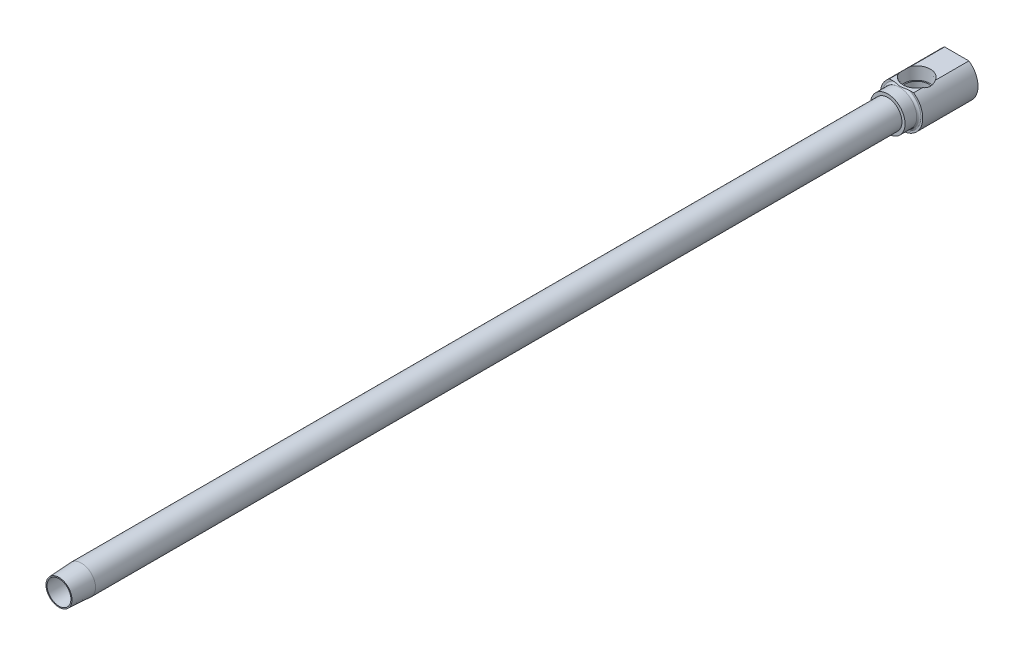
ISO-10303-21;
HEADER;
FILE_DESCRIPTION(('STEP AP214'),'2;1');
FILE_NAME('part.step','',(''),(''),'','','');
FILE_SCHEMA(('AUTOMOTIVE_DESIGN { 1 0 10303 214 1 1 1 1 }'));
ENDSEC;
DATA;
#1=APPLICATION_CONTEXT('core data for automotive mechanical design processes');
#2=APPLICATION_PROTOCOL_DEFINITION('international standard','automotive_design',2000,#1);
#3=PRODUCT_CONTEXT('',#1,'mechanical');
#4=PRODUCT('Part','Part','',(#3));
#5=PRODUCT_RELATED_PRODUCT_CATEGORY('part','',(#4));
#6=PRODUCT_DEFINITION_FORMATION('','',#4);
#7=PRODUCT_DEFINITION_CONTEXT('part definition',#1,'design');
#8=PRODUCT_DEFINITION('design','',#6,#7);
#9=PRODUCT_DEFINITION_SHAPE('','',#8);
#10=(LENGTH_UNIT() NAMED_UNIT(*) SI_UNIT(.MILLI.,.METRE.));
#11=(NAMED_UNIT(*) PLANE_ANGLE_UNIT() SI_UNIT($,.RADIAN.));
#12=(NAMED_UNIT(*) SI_UNIT($,.STERADIAN.) SOLID_ANGLE_UNIT());
#13=UNCERTAINTY_MEASURE_WITH_UNIT(LENGTH_MEASURE(1.E-05),#10,'distance_accuracy_value','');
#14=(GEOMETRIC_REPRESENTATION_CONTEXT(3) GLOBAL_UNCERTAINTY_ASSIGNED_CONTEXT((#13)) GLOBAL_UNIT_ASSIGNED_CONTEXT((#10,
#11,#12)) REPRESENTATION_CONTEXT('',''));
#15=CARTESIAN_POINT('',(0.,0.,0.));
#16=DIRECTION('',(0.,0.,1.));
#17=DIRECTION('',(1.,0.,0.));
#18=AXIS2_PLACEMENT_3D('',#15,#16,#17);
#19=CARTESIAN_POINT('',(-4.3815,0.,0.));
#20=DIRECTION('',(0.,0.,1.));
#21=DIRECTION('',(1.,0.,0.));
#22=AXIS2_PLACEMENT_3D('',#19,#20,#21);
#23=PLANE('',#22);
#24=CARTESIAN_POINT('',(0.,0.,0.));
#25=DIRECTION('',(0.,0.,-1.));
#26=DIRECTION('',(-1.,0.,0.));
#27=AXIS2_PLACEMENT_3D('',#24,#25,#26);
#28=CIRCLE('',#27,4.3815);
#29=CARTESIAN_POINT('',(-4.3815,0.,0.));
#30=VERTEX_POINT('',#29);
#31=EDGE_CURVE('E18',#30,#30,#28,.T.);
#32=ORIENTED_EDGE('',*,*,#31,.T.);
#33=EDGE_LOOP('',(#32));
#34=FACE_BOUND('',#33,.T.);
#35=CARTESIAN_POINT('',(0.,0.,0.));
#36=DIRECTION('',(0.,0.,-1.));
#37=DIRECTION('',(-1.,0.,0.));
#38=AXIS2_PLACEMENT_3D('',#35,#36,#37);
#39=CIRCLE('',#38,4.7752);
#40=CARTESIAN_POINT('',(-4.7752,0.,0.));
#41=VERTEX_POINT('',#40);
#42=EDGE_CURVE('E148',#41,#41,#39,.T.);
#43=ORIENTED_EDGE('',*,*,#42,.F.);
#44=EDGE_LOOP('',(#43));
#45=FACE_BOUND('',#44,.T.);
#46=ADVANCED_FACE('F15',(#34,#45),#23,.T.);
#47=CARTESIAN_POINT('',(0.,0.,-372.072366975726));
#48=DIRECTION('',(0.,0.,-1.));
#49=DIRECTION('',(-1.,0.,0.));
#50=AXIS2_PLACEMENT_3D('',#47,#48,#49);
#51=CYLINDRICAL_SURFACE('',#50,5.207);
#52=CARTESIAN_POINT('',(0.,0.,-8.23923482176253));
#53=DIRECTION('',(0.,0.,-1.));
#54=DIRECTION('',(-1.,0.,0.));
#55=AXIS2_PLACEMENT_3D('',#52,#53,#54);
#56=CIRCLE('',#55,5.207);
#57=CARTESIAN_POINT('',(-5.207,0.,-8.23923482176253));
#58=VERTEX_POINT('',#57);
#59=EDGE_CURVE('E150',#58,#58,#56,.T.);
#60=ORIENTED_EDGE('',*,*,#59,.T.);
#61=EDGE_LOOP('',(#60));
#62=FACE_BOUND('',#61,.T.);
#63=CARTESIAN_POINT('',(0.,0.,-304.8254));
#64=DIRECTION('',(0.,0.,-1.));
#65=DIRECTION('',(-1.,0.,0.));
#66=AXIS2_PLACEMENT_3D('',#63,#64,#65);
#67=CIRCLE('',#66,5.207);
#68=CARTESIAN_POINT('',(-5.207,0.,-304.8254));
#69=VERTEX_POINT('',#68);
#70=EDGE_CURVE('E240',#69,#69,#67,.T.);
#71=ORIENTED_EDGE('',*,*,#70,.F.);
#72=EDGE_LOOP('',(#71));
#73=FACE_BOUND('',#72,.T.);
#74=ADVANCED_FACE('F135',(#62,#73),#51,.T.);
#75=CARTESIAN_POINT('',(-4.4577,6.41348742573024,-296.8752));
#76=DIRECTION('',(0.,-1.,0.));
#77=DIRECTION('',(0.,0.,-1.));
#78=AXIS2_PLACEMENT_3D('',#75,#76,#77);
#79=PLANE('',#78);
#80=DIRECTION('',(0.,0.,-1.));
#81=VECTOR('',#80,1.);
#82=CARTESIAN_POINT('',(4.4577,6.41348742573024,-296.8752));
#83=LINE('',#82,#81);
#84=CARTESIAN_POINT('',(4.4577,6.41348742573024,-309.88));
#85=VERTEX_POINT('',#84);
#86=CARTESIAN_POINT('',(4.4577,6.41348742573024,-313.121408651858));
#87=VERTEX_POINT('',#86);
#88=EDGE_CURVE('E293',#85,#87,#83,.T.);
#89=ORIENTED_EDGE('',*,*,#88,.T.);
#90=CARTESIAN_POINT('',(0.,6.41348742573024,-315.468));
#91=DIRECTION('',(0.,-1.,0.));
#92=DIRECTION('',(0.,0.,-1.));
#93=AXIS2_PLACEMENT_3D('',#90,#91,#92);
#94=CIRCLE('',#93,5.03761652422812);
#95=CARTESIAN_POINT('',(-4.4577,6.41348742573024,-313.121408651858));
#96=VERTEX_POINT('',#95);
#97=EDGE_CURVE('E157',#87,#96,#94,.T.);
#98=ORIENTED_EDGE('',*,*,#97,.T.);
#99=DIRECTION('',(0.,0.,-1.));
#100=VECTOR('',#99,1.);
#101=CARTESIAN_POINT('',(-4.4577,6.41348742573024,-296.8752));
#102=LINE('',#101,#100);
#103=CARTESIAN_POINT('',(-4.4577,6.41348742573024,-309.88));
#104=VERTEX_POINT('',#103);
#105=EDGE_CURVE('E291',#104,#96,#102,.T.);
#106=ORIENTED_EDGE('',*,*,#105,.F.);
#107=DIRECTION('',(1.,0.,0.));
#108=VECTOR('',#107,1.);
#109=CARTESIAN_POINT('',(-7.112,6.41348742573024,-309.88));
#110=LINE('',#109,#108);
#111=CARTESIAN_POINT('',(-3.07371485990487,6.41348742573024,-309.88));
#112=VERTEX_POINT('',#111);
#113=EDGE_CURVE('E282',#104,#112,#110,.T.);
#114=ORIENTED_EDGE('',*,*,#113,.T.);
#115=CARTESIAN_POINT('',(0.,6.41348742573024,-309.422506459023));
#116=CARTESIAN_POINT('',(0.0547669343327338,6.41348742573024,-309.422502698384));
#117=CARTESIAN_POINT('',(0.109530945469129,6.41348742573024,-309.424131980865));
#118=CARTESIAN_POINT('',(0.218888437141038,6.41348742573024,-309.430434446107));
#119=CARTESIAN_POINT('',(0.273481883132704,6.41348742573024,-309.43510820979));
#120=CARTESIAN_POINT('',(0.437133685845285,6.41348742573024,-309.452954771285));
#121=CARTESIAN_POINT('',(0.545759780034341,6.41348742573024,-309.469948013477));
#122=CARTESIAN_POINT('',(0.763468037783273,6.41348742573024,-309.509460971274));
#123=CARTESIAN_POINT('',(0.872535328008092,6.41348742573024,-309.532054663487));
#124=CARTESIAN_POINT('',(1.09015205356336,6.41348742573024,-309.579005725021));
#125=CARTESIAN_POINT('',(1.19870193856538,6.41348742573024,-309.60336104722));
#126=CARTESIAN_POINT('',(1.441224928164,6.41348742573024,-309.657231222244));
#127=CARTESIAN_POINT('',(1.57522547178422,6.41348742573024,-309.686625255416));
#128=CARTESIAN_POINT('',(1.84407607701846,6.41348742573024,-309.741759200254));
#129=CARTESIAN_POINT('',(1.97892653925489,6.41348742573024,-309.767497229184));
#130=CARTESIAN_POINT('',(2.24890278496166,6.41348742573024,-309.812646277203));
#131=CARTESIAN_POINT('',(2.38402236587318,6.41348742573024,-309.832093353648));
#132=CARTESIAN_POINT('',(2.65521795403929,6.41348742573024,-309.862201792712));
#133=CARTESIAN_POINT('',(2.79129309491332,6.41348742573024,-309.872870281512));
#134=CARTESIAN_POINT('',(2.99640645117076,6.41348742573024,-309.879807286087));
#135=CARTESIAN_POINT('',(3.06529255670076,6.41348742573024,-309.880589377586));
#136=CARTESIAN_POINT('',(3.20300193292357,6.41348742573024,-309.878500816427));
#137=CARTESIAN_POINT('',(3.27182521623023,6.41348742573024,-309.875631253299));
#138=CARTESIAN_POINT('',(3.40907712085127,6.41348742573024,-309.865580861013));
#139=CARTESIAN_POINT('',(3.47750615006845,6.41348742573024,-309.858405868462));
#140=CARTESIAN_POINT('',(3.61360674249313,6.41348742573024,-309.838913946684));
#141=CARTESIAN_POINT('',(3.68127881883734,6.41348742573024,-309.826600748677));
#142=CARTESIAN_POINT('',(3.81134745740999,6.41348742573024,-309.796638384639));
#143=CARTESIAN_POINT('',(3.8738228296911,6.41348742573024,-309.779338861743));
#144=CARTESIAN_POINT('',(3.99661419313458,6.41348742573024,-309.737990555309));
#145=CARTESIAN_POINT('',(4.05692926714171,6.41348742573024,-309.713938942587));
#146=CARTESIAN_POINT('',(4.16438836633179,6.41348742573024,-309.661987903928));
#147=CARTESIAN_POINT('',(4.21210790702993,6.41348742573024,-309.635296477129));
#148=CARTESIAN_POINT('',(4.30289303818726,6.41348742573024,-309.574877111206));
#149=CARTESIAN_POINT('',(4.34597104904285,6.41348742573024,-309.541168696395));
#150=CARTESIAN_POINT('',(4.40881816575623,6.41348742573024,-309.480664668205));
#151=CARTESIAN_POINT('',(4.43105110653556,6.41348742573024,-309.456438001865));
#152=CARTESIAN_POINT('',(4.47168650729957,6.41348742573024,-309.404939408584));
#153=CARTESIAN_POINT('',(4.49009362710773,6.41348742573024,-309.377671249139));
#154=CARTESIAN_POINT('',(4.51921410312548,6.41348742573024,-309.32504266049));
#155=CARTESIAN_POINT('',(4.53069614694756,6.41348742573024,-309.300111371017));
#156=CARTESIAN_POINT('',(4.54935954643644,6.41348742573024,-309.24867800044));
#157=CARTESIAN_POINT('',(4.55654415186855,6.41348742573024,-309.222177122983));
#158=CARTESIAN_POINT('',(4.56604079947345,6.41348742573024,-309.168144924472));
#159=CARTESIAN_POINT('',(4.56832514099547,6.41348742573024,-309.140608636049));
#160=CARTESIAN_POINT('',(4.56771494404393,6.41348742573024,-309.085594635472));
#161=CARTESIAN_POINT('',(4.56482077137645,6.41348742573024,-309.058116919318));
#162=CARTESIAN_POINT('',(4.55461750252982,6.41348742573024,-309.006573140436));
#163=CARTESIAN_POINT('',(4.54772671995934,6.41348742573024,-308.982421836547));
#164=CARTESIAN_POINT('',(4.53037439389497,6.41348742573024,-308.935451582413));
#165=CARTESIAN_POINT('',(4.51991160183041,6.41348742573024,-308.912633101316));
#166=CARTESIAN_POINT('',(4.49089034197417,6.41348742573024,-308.859253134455));
#167=CARTESIAN_POINT('',(4.47078194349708,6.41348742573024,-308.829535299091));
#168=CARTESIAN_POINT('',(4.42607813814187,6.41348742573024,-308.773694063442));
#169=CARTESIAN_POINT('',(4.4014723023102,6.41348742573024,-308.7475792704));
#170=CARTESIAN_POINT('',(4.33512083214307,6.41348742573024,-308.685846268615));
#171=CARTESIAN_POINT('',(4.29121960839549,6.41348742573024,-308.652560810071));
#172=CARTESIAN_POINT('',(4.19894894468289,6.41348742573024,-308.592992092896));
#173=CARTESIAN_POINT('',(4.15057028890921,6.41348742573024,-308.566723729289));
#174=CARTESIAN_POINT('',(4.05679374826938,6.41348742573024,-308.522729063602));
#175=CARTESIAN_POINT('',(4.01168660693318,6.41348742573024,-308.504369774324));
#176=CARTESIAN_POINT('',(3.92005010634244,6.41348742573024,-308.471582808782));
#177=CARTESIAN_POINT('',(3.87351963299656,6.41348742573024,-308.457158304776));
#178=CARTESIAN_POINT('',(3.73245646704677,6.41348742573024,-308.418915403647));
#179=CARTESIAN_POINT('',(3.63654836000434,6.41348742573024,-308.400169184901));
#180=CARTESIAN_POINT('',(3.44110716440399,6.41348742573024,-308.372600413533));
#181=CARTESIAN_POINT('',(3.34154251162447,6.41348742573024,-308.364028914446));
#182=CARTESIAN_POINT('',(3.14195452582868,6.41348742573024,-308.355217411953));
#183=CARTESIAN_POINT('',(3.04193075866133,6.41348742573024,-308.354988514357));
#184=CARTESIAN_POINT('',(2.84160218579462,6.41348742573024,-308.361135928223));
#185=CARTESIAN_POINT('',(2.74129862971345,6.41348742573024,-308.36754664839));
#186=CARTESIAN_POINT('',(2.54132534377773,6.41348742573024,-308.385618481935));
#187=CARTESIAN_POINT('',(2.4416549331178,6.41348742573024,-308.397272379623));
#188=CARTESIAN_POINT('',(2.13711894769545,6.41348742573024,-308.439263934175));
#189=CARTESIAN_POINT('',(1.93319771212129,6.41348742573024,-308.47628574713));
#190=CARTESIAN_POINT('',(1.62827949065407,6.41348742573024,-308.538357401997));
#191=CARTESIAN_POINT('',(1.52655364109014,6.41348742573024,-308.560199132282));
#192=CARTESIAN_POINT('',(1.32330984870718,6.41348742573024,-308.60483124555));
#193=CARTESIAN_POINT('',(1.22179189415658,6.41348742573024,-308.627621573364));
#194=CARTESIAN_POINT('',(1.0205863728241,6.41348742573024,-308.67212134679));
#195=CARTESIAN_POINT('',(0.920901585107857,6.41348742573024,-308.69384319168));
#196=CARTESIAN_POINT('',(0.720902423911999,6.41348742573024,-308.73448684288));
#197=CARTESIAN_POINT('',(0.620587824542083,6.41348742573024,-308.753407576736));
#198=CARTESIAN_POINT('',(0.419827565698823,6.41348742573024,-308.784865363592));
#199=CARTESIAN_POINT('',(0.31939208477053,6.41348742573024,-308.797460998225));
#200=CARTESIAN_POINT('',(0.168224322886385,6.41348742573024,-308.808901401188));
#201=CARTESIAN_POINT('',(0.117779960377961,6.41348742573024,-308.811473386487));
#202=CARTESIAN_POINT('',(0.0168277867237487,6.41348742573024,-308.81389611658));
#203=CARTESIAN_POINT('',(-0.0336800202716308,6.41348742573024,-308.813747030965));
#204=CARTESIAN_POINT('',(-0.167203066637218,6.41348742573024,-308.809734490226));
#205=CARTESIAN_POINT('',(-0.25015161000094,6.41348742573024,-308.803534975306));
#206=CARTESIAN_POINT('',(-0.415406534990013,6.41348742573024,-308.785308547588));
#207=CARTESIAN_POINT('',(-0.49771241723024,6.41348742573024,-308.773277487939));
#208=CARTESIAN_POINT('',(-0.662364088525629,6.41348742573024,-308.745484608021));
#209=CARTESIAN_POINT('',(-0.744704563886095,6.41348742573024,-308.729692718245));
#210=CARTESIAN_POINT('',(-0.908954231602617,6.41348742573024,-308.696225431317));
#211=CARTESIAN_POINT('',(-0.99086358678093,6.41348742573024,-308.678550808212));
#212=CARTESIAN_POINT('',(-1.15599570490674,6.41348742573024,-308.6422569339));
#213=CARTESIAN_POINT('',(-1.23921597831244,6.41348742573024,-308.623626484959));
#214=CARTESIAN_POINT('',(-1.4057208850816,6.41348742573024,-308.586671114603));
#215=CARTESIAN_POINT('',(-1.48900551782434,6.41348742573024,-308.56834619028));
#216=CARTESIAN_POINT('',(-1.73866654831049,6.41348742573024,-308.515071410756));
#217=CARTESIAN_POINT('',(-1.90540243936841,6.41348742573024,-308.48168897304));
#218=CARTESIAN_POINT('',(-2.16681921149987,6.41348742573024,-308.436734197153));
#219=CARTESIAN_POINT('',(-2.26095047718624,6.41348742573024,-308.422025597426));
#220=CARTESIAN_POINT('',(-2.44971550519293,6.41348742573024,-308.396348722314));
#221=CARTESIAN_POINT('',(-2.54434917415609,6.41348742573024,-308.385379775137));
#222=CARTESIAN_POINT('',(-2.73368335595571,6.41348742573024,-308.368201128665));
#223=CARTESIAN_POINT('',(-2.82838206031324,6.41348742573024,-308.361972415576));
#224=CARTESIAN_POINT('',(-3.01793602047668,6.41348742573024,-308.355372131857));
#225=CARTESIAN_POINT('',(-3.11279113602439,6.41348742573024,-308.354996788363));
#226=CARTESIAN_POINT('',(-3.31218734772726,6.41348742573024,-308.361898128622));
#227=CARTESIAN_POINT('',(-3.41671052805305,6.41348742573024,-308.36997414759));
#228=CARTESIAN_POINT('',(-3.5723466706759,6.41348742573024,-308.390810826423));
#229=CARTESIAN_POINT('',(-3.62404703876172,6.41348742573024,-308.399213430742));
#230=CARTESIAN_POINT('',(-3.72677708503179,6.41348742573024,-308.419392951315));
#231=CARTESIAN_POINT('',(-3.77780699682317,6.41348742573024,-308.431168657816));
#232=CARTESIAN_POINT('',(-3.89634421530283,6.41348742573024,-308.463403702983));
#233=CARTESIAN_POINT('',(-3.9634317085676,6.41348742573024,-308.485458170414));
#234=CARTESIAN_POINT('',(-4.094058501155,6.41348742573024,-308.538413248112));
#235=CARTESIAN_POINT('',(-4.1576046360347,6.41348742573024,-308.569296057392));
#236=CARTESIAN_POINT('',(-4.25441976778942,6.41348742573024,-308.627888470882));
#237=CARTESIAN_POINT('',(-4.28979385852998,6.41348742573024,-308.6520976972));
#238=CARTESIAN_POINT('',(-4.35685699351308,6.41348742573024,-308.705223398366));
#239=CARTESIAN_POINT('',(-4.38855051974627,6.41348742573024,-308.73413404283));
#240=CARTESIAN_POINT('',(-4.4393789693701,6.41348742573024,-308.789413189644));
#241=CARTESIAN_POINT('',(-4.45969325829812,6.41348742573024,-308.81468864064));
#242=CARTESIAN_POINT('',(-4.49606293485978,6.41348742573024,-308.86815327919));
#243=CARTESIAN_POINT('',(-4.51212457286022,6.41348742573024,-308.896338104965));
#244=CARTESIAN_POINT('',(-4.53626721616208,6.41348742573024,-308.949729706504));
#245=CARTESIAN_POINT('',(-4.54527744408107,6.41348742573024,-308.974513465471));
#246=CARTESIAN_POINT('',(-4.5590260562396,6.41348742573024,-309.025243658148));
#247=CARTESIAN_POINT('',(-4.56376753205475,6.41348742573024,-309.051189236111));
#248=CARTESIAN_POINT('',(-4.56859445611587,6.41348742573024,-309.103605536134));
#249=CARTESIAN_POINT('',(-4.56866422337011,6.41348742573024,-309.130077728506));
#250=CARTESIAN_POINT('',(-4.5641015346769,6.41348742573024,-309.182612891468));
#251=CARTESIAN_POINT('',(-4.55946793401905,6.41348742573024,-309.208675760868));
#252=CARTESIAN_POINT('',(-4.54620785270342,6.41348742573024,-309.258450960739));
#253=CARTESIAN_POINT('',(-4.53777611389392,6.41348742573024,-309.28221625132));
#254=CARTESIAN_POINT('',(-4.51754524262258,6.41348742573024,-309.328251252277));
#255=CARTESIAN_POINT('',(-4.50574488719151,6.41348742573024,-309.350520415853));
#256=CARTESIAN_POINT('',(-4.47265204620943,6.41348742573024,-309.404236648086));
#257=CARTESIAN_POINT('',(-4.44958451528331,6.41348742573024,-309.434590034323));
#258=CARTESIAN_POINT('',(-4.39893449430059,6.41348742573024,-309.491262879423));
#259=CARTESIAN_POINT('',(-4.37134039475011,6.41348742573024,-309.517571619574));
#260=CARTESIAN_POINT('',(-4.29637766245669,6.41348742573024,-309.580336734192));
#261=CARTESIAN_POINT('',(-4.24670632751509,6.41348742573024,-309.614023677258));
#262=CARTESIAN_POINT('',(-4.14294758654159,6.41348742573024,-309.673603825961));
#263=CARTESIAN_POINT('',(-4.08885088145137,6.41348742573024,-309.6994800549));
#264=CARTESIAN_POINT('',(-3.98330416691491,6.41348742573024,-309.74266584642));
#265=CARTESIAN_POINT('',(-3.93208515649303,6.41348742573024,-309.760552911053));
#266=CARTESIAN_POINT('',(-3.82828626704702,6.41348742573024,-309.791892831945));
#267=CARTESIAN_POINT('',(-3.77570527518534,6.41348742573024,-309.805341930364));
#268=CARTESIAN_POINT('',(-3.66966451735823,6.41348742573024,-309.828467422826));
#269=CARTESIAN_POINT('',(-3.61620370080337,6.41348742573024,-309.838138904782));
#270=CARTESIAN_POINT('',(-3.50882362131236,6.41348742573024,-309.854213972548));
#271=CARTESIAN_POINT('',(-3.45490452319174,6.41348742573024,-309.860618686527));
#272=CARTESIAN_POINT('',(-3.32893010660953,6.41348742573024,-309.872254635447));
#273=CARTESIAN_POINT('',(-3.25677506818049,6.41348742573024,-309.876396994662));
#274=CARTESIAN_POINT('',(-3.11233636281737,6.41348742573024,-309.880499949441));
#275=CARTESIAN_POINT('',(-3.04005265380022,6.41348742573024,-309.880458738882));
#276=CARTESIAN_POINT('',(-2.82311145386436,6.41348742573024,-309.875065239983));
#277=CARTESIAN_POINT('',(-2.6785850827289,6.41348742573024,-309.864427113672));
#278=CARTESIAN_POINT('',(-2.38941343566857,6.41348742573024,-309.833026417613));
#279=CARTESIAN_POINT('',(-2.24477928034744,6.41348742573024,-309.812171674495));
#280=CARTESIAN_POINT('',(-1.95690250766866,6.41348742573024,-309.763578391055));
#281=CARTESIAN_POINT('',(-1.81365833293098,6.41348742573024,-309.735848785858));
#282=CARTESIAN_POINT('',(-1.5310803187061,6.41348742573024,-309.677154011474));
#283=CARTESIAN_POINT('',(-1.39172865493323,6.41348742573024,-309.64627129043));
#284=CARTESIAN_POINT('',(-1.1825958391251,6.41348742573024,-309.599745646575));
#285=CARTESIAN_POINT('',(-1.11279428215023,6.41348742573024,-309.584187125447));
#286=CARTESIAN_POINT('',(-0.973069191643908,6.41348742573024,-309.553631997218));
#287=CARTESIAN_POINT('',(-0.903145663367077,6.41348742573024,-309.538635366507));
#288=CARTESIAN_POINT('',(-0.76429608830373,6.41348742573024,-309.510259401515));
#289=CARTESIAN_POINT('',(-0.69537516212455,6.41348742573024,-309.496855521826));
#290=CARTESIAN_POINT('',(-0.557105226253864,6.41348742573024,-309.472372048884));
#291=CARTESIAN_POINT('',(-0.487756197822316,6.41348742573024,-309.461292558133));
#292=CARTESIAN_POINT('',(-0.348841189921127,6.41348742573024,-309.442764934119));
#293=CARTESIAN_POINT('',(-0.279277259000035,6.41348742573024,-309.435302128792));
#294=CARTESIAN_POINT('',(-0.139807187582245,6.41348742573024,-309.425176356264));
#295=CARTESIAN_POINT('',(-0.0699012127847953,6.41348742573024,-309.422511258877));
#296=CARTESIAN_POINT('',(0.,6.41348742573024,-309.422506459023));
#297=B_SPLINE_CURVE_WITH_KNOTS('',3,(#115,#116,#117,#118,#119,#120,#121,#122,#123,#124,#125,
#126,#127,#128,#129,#130,#131,#132,#133,#134,#135,#136,#137,#138,#139,#140,#141,#142,#143,#144,
#145,#146,#147,#148,#149,#150,#151,#152,#153,#154,#155,#156,#157,#158,#159,#160,#161,#162,#163,
#164,#165,#166,#167,#168,#169,#170,#171,#172,#173,#174,#175,#176,#177,#178,#179,#180,#181,#182,
#183,#184,#185,#186,#187,#188,#189,#190,#191,#192,#193,#194,#195,#196,#197,#198,#199,#200,#201,
#202,#203,#204,#205,#206,#207,#208,#209,#210,#211,#212,#213,#214,#215,#216,#217,#218,#219,#220,
#221,#222,#223,#224,#225,#226,#227,#228,#229,#230,#231,#232,#233,#234,#235,#236,#237,#238,#239,
#240,#241,#242,#243,#244,#245,#246,#247,#248,#249,#250,#251,#252,#253,#254,#255,#256,#257,#258,
#259,#260,#261,#262,#263,#264,#265,#266,#267,#268,#269,#270,#271,#272,#273,#274,#275,#276,#277,
#278,#279,#280,#281,#282,#283,#284,#285,#286,#287,#288,#289,#290,#291,#292,#293,#294,#295,#296),
.UNSPECIFIED.,.T.,.F.,(4,2,2,2,2,2,2,2,2,2,2,2,2,2,2,2,2,2,2,2,2,2,2,2,2,2,2,2,2,2,2,2,2,2,2,2,
2,2,2,2,2,2,2,2,2,2,2,2,2,2,2,2,2,2,2,2,2,2,2,2,2,2,2,2,2,2,2,2,2,2,2,2,2,2,2,2,2,2,2,2,2,2,2,2,
2,2,2,2,2,2,4),(0.,0.164273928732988,0.32857921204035,0.658096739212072,0.992223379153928,
1.32596779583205,1.73751584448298,2.14927506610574,2.55863060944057,2.96765352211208,
3.17424892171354,3.38078269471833,3.58703711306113,3.79314201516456,3.98733137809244,
4.18160222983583,4.34518473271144,4.50831802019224,4.60668262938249,4.70492671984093,
4.78693922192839,4.86888962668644,4.95130208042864,5.03370871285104,5.10874003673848,
5.18379761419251,5.29083718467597,5.39812818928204,5.56248306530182,5.72718409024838,
5.87307196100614,6.01907710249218,6.31139884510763,6.61079267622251,6.91058505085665,
7.21193886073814,7.51287920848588,8.13412004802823,8.44626765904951,8.75839714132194,
9.06445930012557,9.37063833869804,9.67392675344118,9.82538795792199,9.97683972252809,
10.2260774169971,10.4754926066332,10.7269732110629,10.9783508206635,11.2341897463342,
11.4900262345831,11.9999950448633,12.2857569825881,12.5714675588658,12.8560259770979,
13.1404009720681,13.4543312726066,13.6113768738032,13.7683662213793,13.9797728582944,
14.1907561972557,14.3190471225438,14.4471801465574,14.5441362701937,14.6409490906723,
14.7197308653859,14.7984555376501,14.8774444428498,14.9564525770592,15.0318037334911,
15.1071822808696,15.2209045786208,15.3349232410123,15.5139662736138,15.6933957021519,
15.8559161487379,16.0185738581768,16.1814423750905,16.3442546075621,16.5609200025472,
16.7776789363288,17.2118589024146,17.6500302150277,18.0876350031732,18.5158248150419,
18.7303690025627,18.9449041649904,19.1555191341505,19.3661433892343,19.5759058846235,
19.7855752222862),.UNSPECIFIED.);
#298=CARTESIAN_POINT('',(3.07371485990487,6.41348742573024,-309.88));
#299=VERTEX_POINT('',#298);
#300=EDGE_CURVE('E232',#112,#299,#297,.T.);
#301=ORIENTED_EDGE('',*,*,#300,.T.);
#302=EDGE_CURVE('E297',#299,#85,#110,.T.);
#303=ORIENTED_EDGE('',*,*,#302,.T.);
#304=EDGE_LOOP('',(#89,#98,#106,#114,#301,#303));
#305=FACE_BOUND('',#304,.T.);
#306=ADVANCED_FACE('F141',(#305),#79,.F.);
#307=CARTESIAN_POINT('',(0.,0.,-372.072366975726));
#308=DIRECTION('',(0.,0.,-1.));
#309=DIRECTION('',(-1.,0.,0.));
#310=AXIS2_PLACEMENT_3D('',#307,#308,#309);
#311=CYLINDRICAL_SURFACE('',#310,4.3815);
#312=ORIENTED_EDGE('',*,*,#31,.F.);
#313=EDGE_LOOP('',(#312));
#314=FACE_BOUND('',#313,.T.);
#315=CARTESIAN_POINT('',(0.,0.,-304.8254));
#316=DIRECTION('',(0.,0.,-1.));
#317=DIRECTION('',(-1.,0.,0.));
#318=AXIS2_PLACEMENT_3D('',#315,#316,#317);
#319=CIRCLE('',#318,4.3815);
#320=CARTESIAN_POINT('',(-3.16538744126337,-3.02949906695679,-304.8254));
#321=VERTEX_POINT('',#320);
#322=CARTESIAN_POINT('',(3.16538744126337,-3.02949906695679,-304.8254));
#323=VERTEX_POINT('',#322);
#324=EDGE_CURVE('E235',#321,#323,#319,.T.);
#325=ORIENTED_EDGE('',*,*,#324,.T.);
#326=CARTESIAN_POINT('',(3.16547479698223,-3.02940779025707,-304.8256));
#327=CARTESIAN_POINT('',(3.14342446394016,-3.05243943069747,-304.775077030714));
#328=CARTESIAN_POINT('',(3.11972293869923,-3.07670954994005,-304.725848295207));
#329=CARTESIAN_POINT('',(3.0688820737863,-3.12742914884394,-304.630394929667));
#330=CARTESIAN_POINT('',(3.04174325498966,-3.1538782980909,-304.584169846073));
#331=CARTESIAN_POINT('',(2.95559153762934,-3.2354582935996,-304.451577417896));
#332=CARTESIAN_POINT('',(2.89136505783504,-3.29334010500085,-304.370167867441));
#333=CARTESIAN_POINT('',(2.75011359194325,-3.41217163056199,-304.222271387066));
#334=CARTESIAN_POINT('',(2.67308610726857,-3.47312194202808,-304.15578737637));
#335=CARTESIAN_POINT('',(2.50819184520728,-3.59402230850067,-304.03634210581));
#336=CARTESIAN_POINT('',(2.42029620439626,-3.653969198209,-303.983418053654));
#337=CARTESIAN_POINT('',(2.2577571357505,-3.75593106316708,-303.900236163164));
#338=CARTESIAN_POINT('',(2.18486784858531,-3.79884421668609,-303.867575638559));
#339=CARTESIAN_POINT('',(2.03488862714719,-3.88124850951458,-303.807990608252));
#340=CARTESIAN_POINT('',(1.95779677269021,-3.92073806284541,-303.781068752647));
#341=CARTESIAN_POINT('',(1.80004579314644,-3.99562399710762,-303.732117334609));
#342=CARTESIAN_POINT('',(1.71938265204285,-4.03101559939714,-303.710093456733));
#343=CARTESIAN_POINT('',(1.55515017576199,-4.09718246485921,-303.670304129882));
#344=CARTESIAN_POINT('',(1.47157967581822,-4.12795585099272,-303.652540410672));
#345=CARTESIAN_POINT('',(1.21289030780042,-4.21425858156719,-303.604005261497));
#346=CARTESIAN_POINT('',(1.03389313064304,-4.26180132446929,-303.579192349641));
#347=CARTESIAN_POINT('',(0.670227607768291,-4.33390350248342,-303.542389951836));
#348=CARTESIAN_POINT('',(0.485562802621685,-4.35847699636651,-303.53039262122));
#349=CARTESIAN_POINT('',(0.191999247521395,-4.37863265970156,-303.520580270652));
#350=CARTESIAN_POINT('',(0.0836976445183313,-4.38203983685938,-303.51893316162));
#351=CARTESIAN_POINT('',(-0.132842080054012,-4.38082235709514,-303.519520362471));
#352=CARTESIAN_POINT('',(-0.241080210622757,-4.37619962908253,-303.521753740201));
#353=CARTESIAN_POINT('',(-0.456961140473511,-4.35895390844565,-303.530180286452));
#354=CARTESIAN_POINT('',(-0.564602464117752,-4.34631610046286,-303.536380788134));
#355=CARTESIAN_POINT('',(-0.778298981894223,-4.31317491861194,-303.55296127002));
#356=CARTESIAN_POINT('',(-0.884354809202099,-4.29267477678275,-303.563339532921));
#357=CARTESIAN_POINT('',(-1.09632494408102,-4.24354696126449,-303.588913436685));
#358=CARTESIAN_POINT('',(-1.20219105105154,-4.21476010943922,-303.604204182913));
#359=CARTESIAN_POINT('',(-1.41060084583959,-4.14965783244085,-303.640134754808));
#360=CARTESIAN_POINT('',(-1.51314609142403,-4.11334599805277,-303.660772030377));
#361=CARTESIAN_POINT('',(-1.71390456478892,-4.03381995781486,-303.708258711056));
#362=CARTESIAN_POINT('',(-1.81212318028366,-3.99061466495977,-303.735100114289));
#363=CARTESIAN_POINT('',(-2.00320334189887,-3.89820353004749,-303.796192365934));
#364=CARTESIAN_POINT('',(-2.09606839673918,-3.84900168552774,-303.830438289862));
#365=CARTESIAN_POINT('',(-2.29534319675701,-3.73428068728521,-303.916661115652));
#366=CARTESIAN_POINT('',(-2.40014619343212,-3.66757137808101,-303.970889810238));
#367=CARTESIAN_POINT('',(-2.5474831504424,-3.5653153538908,-304.064688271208));
#368=CARTESIAN_POINT('',(-2.59488453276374,-3.53092006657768,-304.09796870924));
#369=CARTESIAN_POINT('',(-2.68608105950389,-3.46204578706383,-304.169051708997));
#370=CARTESIAN_POINT('',(-2.72987823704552,-3.42756685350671,-304.206851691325));
#371=CARTESIAN_POINT('',(-2.81247040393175,-3.36010888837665,-304.286220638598));
#372=CARTESIAN_POINT('',(-2.85136068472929,-3.32711374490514,-304.327676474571));
#373=CARTESIAN_POINT('',(-2.92505072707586,-3.2625175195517,-304.415085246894));
#374=CARTESIAN_POINT('',(-2.95985031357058,-3.23091649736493,-304.461038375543));
#375=CARTESIAN_POINT('',(-3.02566242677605,-3.16938090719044,-304.557865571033));
#376=CARTESIAN_POINT('',(-3.05661307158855,-3.13947696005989,-304.608801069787));
#377=CARTESIAN_POINT('',(-3.11423662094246,-3.08232206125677,-304.714485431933));
#378=CARTESIAN_POINT('',(-3.14090735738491,-3.05507245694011,-304.769236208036));
#379=CARTESIAN_POINT('',(-3.16547479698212,-3.02940779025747,-304.8256));
#380=B_SPLINE_CURVE_WITH_KNOTS('',3,(#326,#327,#328,#329,#330,#331,#332,#333,#334,#335,#336,
#337,#338,#339,#340,#341,#342,#343,#344,#345,#346,#347,#348,#349,#350,#351,#352,#353,#354,#355,
#356,#357,#358,#359,#360,#361,#362,#363,#364,#365,#366,#367,#368,#369,#370,#371,#372,#373,#374,
#375,#376,#377,#378,#379),.UNSPECIFIED.,.F.,.F.,(4,2,2,2,2,2,2,2,2,2,2,2,2,2,2,2,2,2,2,2,2,2,2,
2,2,2,4),(0.,0.179155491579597,0.358283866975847,0.712611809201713,1.06700899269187,
1.42236845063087,1.69403668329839,1.96583010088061,2.23793733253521,2.51015486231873,
3.06856026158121,3.62662365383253,3.95140246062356,4.27610326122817,4.60140600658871,
4.9265751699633,5.2584629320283,5.59019268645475,5.92149695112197,6.25258155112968,
6.65760632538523,6.85948934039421,7.0612576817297,7.25815107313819,7.45505288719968,
7.65479552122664,7.85463902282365),.UNSPECIFIED.);
#381=EDGE_CURVE('E203',#323,#321,#380,.T.);
#382=ORIENTED_EDGE('',*,*,#381,.T.);
#383=EDGE_LOOP('',(#325,#382));
#384=FACE_BOUND('',#383,.T.);
#385=ADVANCED_FACE('F234',(#314,#384),#311,.F.);
#386=CARTESIAN_POINT('',(-4.3815,0.,-304.8254));
#387=DIRECTION('',(0.,0.,1.));
#388=DIRECTION('',(1.,0.,0.));
#389=AXIS2_PLACEMENT_3D('',#386,#387,#388);
#390=PLANE('',#389);
#391=ORIENTED_EDGE('',*,*,#324,.F.);
#392=CARTESIAN_POINT('',(0.,-0.364745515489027,-304.8254));
#393=DIRECTION('',(0.,0.,1.));
#394=DIRECTION('',(0.,1.,0.));
#395=AXIS2_PLACEMENT_3D('',#392,#393,#394);
#396=ELLIPSE('',#395,4.20023414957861,4.09504169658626);
#397=EDGE_CURVE('E195',#321,#323,#396,.F.);
#398=ORIENTED_EDGE('',*,*,#397,.T.);
#399=EDGE_LOOP('',(#391,#398));
#400=FACE_BOUND('',#399,.T.);
#401=ADVANCED_FACE('F237',(#400),#390,.T.);
#402=CARTESIAN_POINT('',(-5.207,0.,-304.8254));
#403=DIRECTION('',(0.,0.,1.));
#404=DIRECTION('',(1.,0.,0.));
#405=AXIS2_PLACEMENT_3D('',#402,#403,#404);
#406=PLANE('',#405);
#407=ORIENTED_EDGE('',*,*,#70,.T.);
#408=EDGE_LOOP('',(#407));
#409=FACE_BOUND('',#408,.T.);
#410=CARTESIAN_POINT('',(0.,0.,-304.8254));
#411=DIRECTION('',(0.,0.,-1.));
#412=DIRECTION('',(-1.,0.,0.));
#413=AXIS2_PLACEMENT_3D('',#410,#411,#412);
#414=CIRCLE('',#413,6.35);
#415=CARTESIAN_POINT('',(-6.35,0.,-304.8254));
#416=VERTEX_POINT('',#415);
#417=EDGE_CURVE('E273',#416,#416,#414,.T.);
#418=ORIENTED_EDGE('',*,*,#417,.F.);
#419=EDGE_LOOP('',(#418));
#420=FACE_BOUND('',#419,.T.);
#421=ADVANCED_FACE('F382',(#409,#420),#406,.T.);
#422=CARTESIAN_POINT('',(-7.8105,0.,-330.2));
#423=DIRECTION('',(0.,0.,-1.));
#424=DIRECTION('',(-1.,0.,0.));
#425=AXIS2_PLACEMENT_3D('',#422,#423,#424);
#426=PLANE('',#425);
#427=DIRECTION('',(1.,0.,0.));
#428=VECTOR('',#427,1.);
#429=CARTESIAN_POINT('',(-2.29502505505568,3.9751,-330.2));
#430=LINE('',#429,#428);
#431=CARTESIAN_POINT('',(-2.29502505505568,3.9751,-330.2));
#432=VERTEX_POINT('',#431);
#433=CARTESIAN_POINT('',(2.29502505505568,3.9751,-330.2));
#434=VERTEX_POINT('',#433);
#435=EDGE_CURVE('E236',#432,#434,#430,.T.);
#436=ORIENTED_EDGE('',*,*,#435,.F.);
#437=DIRECTION('',(0.5,0.866025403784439,0.));
#438=VECTOR('',#437,1.);
#439=CARTESIAN_POINT('',(-4.59005011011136,0.,-330.2));
#440=LINE('',#439,#438);
#441=CARTESIAN_POINT('',(-4.59005011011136,0.,-330.2));
#442=VERTEX_POINT('',#441);
#443=EDGE_CURVE('E323',#442,#432,#440,.T.);
#444=ORIENTED_EDGE('',*,*,#443,.F.);
#445=DIRECTION('',(-0.5,0.866025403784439,0.));
#446=VECTOR('',#445,1.);
#447=CARTESIAN_POINT('',(-2.29502505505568,-3.9751,-330.2));
#448=LINE('',#447,#446);
#449=CARTESIAN_POINT('',(-2.29502505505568,-3.9751,-330.2));
#450=VERTEX_POINT('',#449);
#451=EDGE_CURVE('E327',#450,#442,#448,.T.);
#452=ORIENTED_EDGE('',*,*,#451,.F.);
#453=DIRECTION('',(-1.,0.,0.));
#454=VECTOR('',#453,1.);
#455=CARTESIAN_POINT('',(2.29502505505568,-3.9751,-330.2));
#456=LINE('',#455,#454);
#457=CARTESIAN_POINT('',(2.29502505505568,-3.9751,-330.2));
#458=VERTEX_POINT('',#457);
#459=EDGE_CURVE('E330',#458,#450,#456,.T.);
#460=ORIENTED_EDGE('',*,*,#459,.F.);
#461=DIRECTION('',(-0.5,-0.866025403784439,0.));
#462=VECTOR('',#461,1.);
#463=CARTESIAN_POINT('',(4.59005011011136,0.,-330.2));
#464=LINE('',#463,#462);
#465=CARTESIAN_POINT('',(4.59005011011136,0.,-330.2));
#466=VERTEX_POINT('',#465);
#467=EDGE_CURVE('E333',#466,#458,#464,.T.);
#468=ORIENTED_EDGE('',*,*,#467,.F.);
#469=DIRECTION('',(0.5,-0.866025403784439,0.));
#470=VECTOR('',#469,1.);
#471=CARTESIAN_POINT('',(2.29502505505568,3.9751,-330.2));
#472=LINE('',#471,#470);
#473=EDGE_CURVE('E336',#434,#466,#472,.T.);
#474=ORIENTED_EDGE('',*,*,#473,.F.);
#475=EDGE_LOOP('',(#436,#444,#452,#460,#468,#474));
#476=FACE_BOUND('',#475,.T.);
#477=DIRECTION('',(-1.,0.,0.));
#478=VECTOR('',#477,1.);
#479=CARTESIAN_POINT('',(-4.4577,6.41348742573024,-330.2));
#480=LINE('',#479,#478);
#481=CARTESIAN_POINT('',(4.4577,6.41348742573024,-330.2));
#482=VERTEX_POINT('',#481);
#483=CARTESIAN_POINT('',(-4.4577,6.41348742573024,-330.2));
#484=VERTEX_POINT('',#483);
#485=EDGE_CURVE('E306',#482,#484,#480,.T.);
#486=ORIENTED_EDGE('',*,*,#485,.F.);
#487=CARTESIAN_POINT('',(0.,0.,-330.2));
#488=DIRECTION('',(0.,0.,-1.));
#489=DIRECTION('',(-1.,0.,0.));
#490=AXIS2_PLACEMENT_3D('',#487,#488,#489);
#491=CIRCLE('',#490,7.8105);
#492=EDGE_CURVE('E238',#482,#484,#491,.T.);
#493=ORIENTED_EDGE('',*,*,#492,.T.);
#494=EDGE_LOOP('',(#486,#493));
#495=FACE_BOUND('',#494,.T.);
#496=ADVANCED_FACE('F379',(#476,#495),#426,.T.);
#497=CARTESIAN_POINT('',(0.,0.,-372.072366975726));
#498=DIRECTION('',(0.,0.,-1.));
#499=DIRECTION('',(-1.,0.,0.));
#500=AXIS2_PLACEMENT_3D('',#497,#498,#499);
#501=CYLINDRICAL_SURFACE('',#500,7.8105);
#502=CARTESIAN_POINT('',(3.4919694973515,6.98641963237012,-311.795441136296));
#503=CARTESIAN_POINT('',(3.58906870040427,6.93789608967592,-311.891298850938));
#504=CARTESIAN_POINT('',(3.68214837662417,6.88883405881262,-311.99094030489));
#505=CARTESIAN_POINT('',(3.86002319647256,6.79075982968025,-312.197470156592));
#506=CARTESIAN_POINT('',(3.94481473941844,6.74174766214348,-312.304361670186));
#507=CARTESIAN_POINT('',(4.10630083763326,6.64463270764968,-312.525696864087));
#508=CARTESIAN_POINT('',(4.18293982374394,6.59653779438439,-312.640184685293));
#509=CARTESIAN_POINT('',(4.32709776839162,6.50288590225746,-312.875666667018));
#510=CARTESIAN_POINT('',(4.39461854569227,6.45732841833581,-312.99665952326));
#511=CARTESIAN_POINT('',(4.56617688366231,6.33809707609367,-313.335931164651));
#512=CARTESIAN_POINT('',(4.6607595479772,6.26825649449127,-313.560584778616));
#513=CARTESIAN_POINT('',(4.77884662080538,6.17810554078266,-313.908872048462));
#514=CARTESIAN_POINT('',(4.81422585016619,6.15050630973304,-314.02675439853));
#515=CARTESIAN_POINT('',(4.8767452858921,6.10105356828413,-314.265843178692));
#516=CARTESIAN_POINT('',(4.90388968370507,6.07919713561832,-314.38704788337));
#517=CARTESIAN_POINT('',(4.94976694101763,6.04190398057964,-314.633123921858));
#518=CARTESIAN_POINT('',(4.96842532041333,6.02652418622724,-314.758017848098));
#519=CARTESIAN_POINT('',(4.99667728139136,6.00312132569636,-315.009520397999));
#520=CARTESIAN_POINT('',(5.00627099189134,5.99509815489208,-315.136128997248));
#521=CARTESIAN_POINT('',(5.01621670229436,5.98677905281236,-315.389999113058));
#522=CARTESIAN_POINT('',(5.01656623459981,5.98648518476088,-315.517260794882));
#523=CARTESIAN_POINT('',(5.00801128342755,5.99364363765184,-315.771242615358));
#524=CARTESIAN_POINT('',(4.99910747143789,6.00109539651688,-315.897962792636));
#525=CARTESIAN_POINT('',(4.97354185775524,6.02229474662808,-316.137311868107));
#526=CARTESIAN_POINT('',(4.95773418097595,6.03534698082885,-316.250095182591));
#527=CARTESIAN_POINT('',(4.91896243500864,6.0669877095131,-316.473649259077));
#528=CARTESIAN_POINT('',(4.89599540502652,6.08557849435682,-316.584419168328));
#529=CARTESIAN_POINT('',(4.81679293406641,6.14874010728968,-316.912550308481));
#530=CARTESIAN_POINT('',(4.75021164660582,6.20073954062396,-317.126137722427));
#531=CARTESIAN_POINT('',(4.63945981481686,6.28338047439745,-317.415334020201));
#532=CARTESIAN_POINT('',(4.60576203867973,6.30815266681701,-317.496941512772));
#533=CARTESIAN_POINT('',(4.53447848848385,6.35958762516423,-317.657818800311));
#534=CARTESIAN_POINT('',(4.49689343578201,6.38625004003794,-317.737089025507));
#535=CARTESIAN_POINT('',(4.32205340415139,6.50775479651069,-318.082823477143));
#536=CARTESIAN_POINT('',(4.16440692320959,6.61093131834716,-318.336395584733));
#537=CARTESIAN_POINT('',(3.80845756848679,6.82220207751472,-318.811369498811));
#538=CARTESIAN_POINT('',(3.61008660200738,6.93030431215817,-319.032716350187));
#539=CARTESIAN_POINT('',(3.2968276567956,7.08140586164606,-319.325508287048));
#540=CARTESIAN_POINT('',(3.19689867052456,7.12716323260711,-319.411836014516));
#541=CARTESIAN_POINT('',(2.99025804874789,7.21629286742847,-319.576495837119));
#542=CARTESIAN_POINT('',(2.8835694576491,7.25967238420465,-319.654852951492));
#543=CARTESIAN_POINT('',(2.77344990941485,7.30149887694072,-319.729155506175));
#544=B_SPLINE_CURVE_WITH_KNOTS('',3,(#502,#503,#504,#505,#506,#507,#508,#509,#510,#511,#512,
#513,#514,#515,#516,#517,#518,#519,#520,#521,#522,#523,#524,#525,#526,#527,#528,#529,#530,#531,
#532,#533,#534,#535,#536,#537,#538,#539,#540,#541,#542,#543),.UNSPECIFIED.,.F.,.F.,(4,2,2,2,2,2,
2,2,2,2,2,2,2,2,2,2,2,2,2,2,4),(0.,0.434323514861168,0.868834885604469,1.30614015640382,
1.74335807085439,2.50066107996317,2.87871388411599,3.25657393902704,3.63768926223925,
4.01879916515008,4.40001079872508,4.7811947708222,5.12468887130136,5.4683252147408,
6.15438371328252,6.42940501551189,6.70437537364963,7.64709414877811,8.5914022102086,
9.0103175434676,9.42787448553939),.UNSPECIFIED.);
#545=CARTESIAN_POINT('',(4.4577,6.41348742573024,-317.814591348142));
#546=VERTEX_POINT('',#545);
#547=EDGE_CURVE('E30',#87,#546,#544,.T.);
#548=ORIENTED_EDGE('',*,*,#547,.F.);
#549=ORIENTED_EDGE('',*,*,#88,.F.);
#550=CARTESIAN_POINT('',(0.,0.,-309.88));
#551=DIRECTION('',(0.,0.,-1.));
#552=DIRECTION('',(-1.,0.,0.));
#553=AXIS2_PLACEMENT_3D('',#550,#551,#552);
#554=CIRCLE('',#553,7.8105);
#555=EDGE_CURVE('E242',#85,#104,#554,.T.);
#556=ORIENTED_EDGE('',*,*,#555,.T.);
#557=ORIENTED_EDGE('',*,*,#105,.T.);
#558=CARTESIAN_POINT('',(-3.4919694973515,6.98641963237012,-319.140558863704));
#559=CARTESIAN_POINT('',(-3.58906870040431,6.9378960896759,-319.044701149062));
#560=CARTESIAN_POINT('',(-3.68214837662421,6.88883405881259,-318.94505969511));
#561=CARTESIAN_POINT('',(-3.86002319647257,6.79075982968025,-318.738529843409));
#562=CARTESIAN_POINT('',(-3.94481473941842,6.74174766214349,-318.631638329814));
#563=CARTESIAN_POINT('',(-4.10630083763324,6.64463270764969,-318.410303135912));
#564=CARTESIAN_POINT('',(-4.18293982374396,6.59653779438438,-318.295815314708));
#565=CARTESIAN_POINT('',(-4.32709776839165,6.50288590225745,-318.060333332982));
#566=CARTESIAN_POINT('',(-4.39461854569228,6.45732841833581,-317.93934047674));
#567=CARTESIAN_POINT('',(-4.56617688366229,6.33809707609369,-317.600068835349));
#568=CARTESIAN_POINT('',(-4.66075954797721,6.26825649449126,-317.375415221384));
#569=CARTESIAN_POINT('',(-4.77884662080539,6.17810554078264,-317.027127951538));
#570=CARTESIAN_POINT('',(-4.8142258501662,6.15050630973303,-316.90924560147));
#571=CARTESIAN_POINT('',(-4.8767452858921,6.10105356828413,-316.670156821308));
#572=CARTESIAN_POINT('',(-4.90388968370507,6.07919713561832,-316.54895211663));
#573=CARTESIAN_POINT('',(-4.94976694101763,6.04190398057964,-316.302876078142));
#574=CARTESIAN_POINT('',(-4.96842532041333,6.02652418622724,-316.177982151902));
#575=CARTESIAN_POINT('',(-4.99667728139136,6.00312132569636,-315.926479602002));
#576=CARTESIAN_POINT('',(-5.00627099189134,5.99509815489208,-315.799871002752));
#577=CARTESIAN_POINT('',(-5.01621670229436,5.98677905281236,-315.546000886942));
#578=CARTESIAN_POINT('',(-5.0165662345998,5.98648518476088,-315.418739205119));
#579=CARTESIAN_POINT('',(-5.00801128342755,5.99364363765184,-315.164757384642));
#580=CARTESIAN_POINT('',(-4.99910747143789,6.00109539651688,-315.038037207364));
#581=CARTESIAN_POINT('',(-4.97354185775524,6.02229474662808,-314.798688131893));
#582=CARTESIAN_POINT('',(-4.95773418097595,6.03534698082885,-314.685904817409));
#583=CARTESIAN_POINT('',(-4.91896243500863,6.06698770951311,-314.462350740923));
#584=CARTESIAN_POINT('',(-4.8959954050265,6.08557849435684,-314.351580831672));
#585=CARTESIAN_POINT('',(-4.81679293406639,6.1487401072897,-314.023449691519));
#586=CARTESIAN_POINT('',(-4.75021164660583,6.20073954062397,-313.809862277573));
#587=CARTESIAN_POINT('',(-4.63945981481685,6.28338047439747,-313.520665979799));
#588=CARTESIAN_POINT('',(-4.6057620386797,6.30815266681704,-313.439058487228));
#589=CARTESIAN_POINT('',(-4.53447848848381,6.35958762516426,-313.278181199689));
#590=CARTESIAN_POINT('',(-4.49689343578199,6.38625004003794,-313.198910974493));
#591=CARTESIAN_POINT('',(-4.32205340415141,6.50775479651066,-312.853176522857));
#592=CARTESIAN_POINT('',(-4.16440692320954,6.61093131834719,-312.599604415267));
#593=CARTESIAN_POINT('',(-3.80845756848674,6.82220207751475,-312.124630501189));
#594=CARTESIAN_POINT('',(-3.61008660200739,6.93030431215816,-311.903283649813));
#595=CARTESIAN_POINT('',(-3.29682765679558,7.08140586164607,-311.610491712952));
#596=CARTESIAN_POINT('',(-3.19689867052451,7.12716323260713,-311.524163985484));
#597=CARTESIAN_POINT('',(-2.99025804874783,7.2162928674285,-311.359504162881));
#598=CARTESIAN_POINT('',(-2.88356945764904,7.25967238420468,-311.281147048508));
#599=CARTESIAN_POINT('',(-2.77344990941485,7.30149887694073,-311.206844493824));
#600=B_SPLINE_CURVE_WITH_KNOTS('',3,(#558,#559,#560,#561,#562,#563,#564,#565,#566,#567,#568,
#569,#570,#571,#572,#573,#574,#575,#576,#577,#578,#579,#580,#581,#582,#583,#584,#585,#586,#587,
#588,#589,#590,#591,#592,#593,#594,#595,#596,#597,#598,#599),.UNSPECIFIED.,.F.,.F.,(4,2,2,2,2,2,
2,2,2,2,2,2,2,2,2,2,2,2,2,2,4),(0.,0.434323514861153,0.868834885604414,1.30614015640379,
1.74335807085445,2.50066107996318,2.87871388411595,3.256573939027,3.63768926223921,
4.01879916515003,4.40001079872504,4.78119477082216,5.12468887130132,5.46832521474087,
6.15438371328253,6.42940501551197,6.70437537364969,7.64709414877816,8.59140221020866,
9.01031754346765,9.42787448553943),.UNSPECIFIED.);
#601=CARTESIAN_POINT('',(-4.4577,6.41348742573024,-317.814591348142));
#602=VERTEX_POINT('',#601);
#603=EDGE_CURVE('E164',#602,#96,#600,.T.);
#604=ORIENTED_EDGE('',*,*,#603,.F.);
#605=EDGE_CURVE('E303',#602,#484,#102,.T.);
#606=ORIENTED_EDGE('',*,*,#605,.T.);
#607=ORIENTED_EDGE('',*,*,#492,.F.);
#608=EDGE_CURVE('E304',#546,#482,#83,.T.);
#609=ORIENTED_EDGE('',*,*,#608,.F.);
#610=EDGE_LOOP('',(#548,#549,#556,#557,#604,#606,#607,#609));
#611=FACE_BOUND('',#610,.T.);
#612=ADVANCED_FACE('F175',(#611),#501,.T.);
#613=CARTESIAN_POINT('',(-7.112,0.,-309.88));
#614=DIRECTION('',(0.,0.,1.));
#615=DIRECTION('',(1.,0.,0.));
#616=AXIS2_PLACEMENT_3D('',#613,#614,#615);
#617=PLANE('',#616);
#618=ORIENTED_EDGE('',*,*,#113,.F.);
#619=ORIENTED_EDGE('',*,*,#555,.F.);
#620=ORIENTED_EDGE('',*,*,#302,.F.);
#621=CARTESIAN_POINT('',(0.,0.,-309.88));
#622=DIRECTION('',(0.,0.,-1.));
#623=DIRECTION('',(-1.,0.,0.));
#624=AXIS2_PLACEMENT_3D('',#621,#622,#623);
#625=CIRCLE('',#624,7.112);
#626=EDGE_CURVE('E278',#299,#112,#625,.T.);
#627=ORIENTED_EDGE('',*,*,#626,.T.);
#628=EDGE_LOOP('',(#618,#619,#620,#627));
#629=FACE_BOUND('',#628,.T.);
#630=ADVANCED_FACE('F268',(#629),#617,.T.);
#631=CARTESIAN_POINT('',(0.,0.,-309.118));
#632=DIRECTION('',(0.,0.,-1.));
#633=DIRECTION('',(-1.,0.,0.));
#634=AXIS2_PLACEMENT_3D('',#631,#632,#633);
#635=TOROIDAL_SURFACE('',#634,7.112,0.762);
#636=ORIENTED_EDGE('',*,*,#300,.F.);
#637=ORIENTED_EDGE('',*,*,#626,.F.);
#638=EDGE_LOOP('',(#636,#637));
#639=FACE_BOUND('',#638,.T.);
#640=CARTESIAN_POINT('',(0.,0.,-309.118));
#641=DIRECTION('',(0.,0.,-1.));
#642=DIRECTION('',(-1.,0.,0.));
#643=AXIS2_PLACEMENT_3D('',#640,#641,#642);
#644=CIRCLE('',#643,6.35);
#645=CARTESIAN_POINT('',(-6.35,0.,-309.118));
#646=VERTEX_POINT('',#645);
#647=EDGE_CURVE('E276',#646,#646,#644,.T.);
#648=ORIENTED_EDGE('',*,*,#647,.T.);
#649=EDGE_LOOP('',(#648));
#650=FACE_BOUND('',#649,.T.);
#651=ADVANCED_FACE('F251',(#639,#650),#635,.F.);
#652=CARTESIAN_POINT('',(0.,0.,-372.072366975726));
#653=DIRECTION('',(0.,0.,-1.));
#654=DIRECTION('',(-1.,0.,0.));
#655=AXIS2_PLACEMENT_3D('',#652,#653,#654);
#656=CYLINDRICAL_SURFACE('',#655,6.35);
#657=ORIENTED_EDGE('',*,*,#417,.T.);
#658=EDGE_LOOP('',(#657));
#659=FACE_BOUND('',#658,.T.);
#660=ORIENTED_EDGE('',*,*,#647,.F.);
#661=EDGE_LOOP('',(#660));
#662=FACE_BOUND('',#661,.T.);
#663=ADVANCED_FACE('F259',(#659,#662),#656,.T.);
#664=ORIENTED_EDGE('',*,*,#605,.F.);
#665=EDGE_CURVE('E153',#602,#546,#94,.T.);
#666=ORIENTED_EDGE('',*,*,#665,.T.);
#667=ORIENTED_EDGE('',*,*,#608,.T.);
#668=ORIENTED_EDGE('',*,*,#485,.T.);
#669=EDGE_LOOP('',(#664,#666,#667,#668));
#670=FACE_BOUND('',#669,.T.);
#671=ADVANCED_FACE('F254',(#670),#79,.F.);
#672=CARTESIAN_POINT('',(-2.29502505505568,3.9751,-325.374));
#673=DIRECTION('',(0.,1.,0.));
#674=DIRECTION('',(0.,0.,1.));
#675=AXIS2_PLACEMENT_3D('',#672,#673,#674);
#676=PLANE('',#675);
#677=ORIENTED_EDGE('',*,*,#435,.T.);
#678=DIRECTION('',(0.,0.,-1.));
#679=VECTOR('',#678,1.);
#680=CARTESIAN_POINT('',(2.29502505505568,3.9751,-325.374));
#681=LINE('',#680,#679);
#682=CARTESIAN_POINT('',(2.29502505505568,3.9751,-325.374));
#683=VERTEX_POINT('',#682);
#684=EDGE_CURVE('E310',#683,#434,#681,.T.);
#685=ORIENTED_EDGE('',*,*,#684,.F.);
#686=DIRECTION('',(1.,0.,0.));
#687=VECTOR('',#686,1.);
#688=CARTESIAN_POINT('',(-2.29502505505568,3.9751,-325.374));
#689=LINE('',#688,#687);
#690=CARTESIAN_POINT('',(-2.29502505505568,3.9751,-325.374));
#691=VERTEX_POINT('',#690);
#692=EDGE_CURVE('E326',#691,#683,#689,.T.);
#693=ORIENTED_EDGE('',*,*,#692,.F.);
#694=DIRECTION('',(0.,0.,-1.));
#695=VECTOR('',#694,1.);
#696=CARTESIAN_POINT('',(-2.29502505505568,3.9751,-325.374));
#697=LINE('',#696,#695);
#698=EDGE_CURVE('E309',#691,#432,#697,.T.);
#699=ORIENTED_EDGE('',*,*,#698,.T.);
#700=EDGE_LOOP('',(#677,#685,#693,#699));
#701=FACE_BOUND('',#700,.T.);
#702=ADVANCED_FACE('F258',(#701),#676,.F.);
#703=CARTESIAN_POINT('',(-4.59005011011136,0.,-325.374));
#704=DIRECTION('',(-0.866025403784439,0.5,0.));
#705=DIRECTION('',(-0.5,-0.866025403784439,0.));
#706=AXIS2_PLACEMENT_3D('',#703,#704,#705);
#707=PLANE('',#706);
#708=ORIENTED_EDGE('',*,*,#443,.T.);
#709=ORIENTED_EDGE('',*,*,#698,.F.);
#710=DIRECTION('',(0.5,0.866025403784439,0.));
#711=VECTOR('',#710,1.);
#712=CARTESIAN_POINT('',(-4.59005011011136,0.,-325.374));
#713=LINE('',#712,#711);
#714=CARTESIAN_POINT('',(-4.59005011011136,0.,-325.374));
#715=VERTEX_POINT('',#714);
#716=EDGE_CURVE('E314',#715,#691,#713,.T.);
#717=ORIENTED_EDGE('',*,*,#716,.F.);
#718=DIRECTION('',(0.,0.,-1.));
#719=VECTOR('',#718,1.);
#720=CARTESIAN_POINT('',(-4.59005011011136,0.,-325.374));
#721=LINE('',#720,#719);
#722=EDGE_CURVE('E320',#715,#442,#721,.T.);
#723=ORIENTED_EDGE('',*,*,#722,.T.);
#724=EDGE_LOOP('',(#708,#709,#717,#723));
#725=FACE_BOUND('',#724,.T.);
#726=ADVANCED_FACE('F377',(#725),#707,.F.);
#727=CARTESIAN_POINT('',(-2.29502505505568,-3.9751,-325.374));
#728=DIRECTION('',(-0.866025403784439,-0.5,0.));
#729=DIRECTION('',(0.5,-0.866025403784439,0.));
#730=AXIS2_PLACEMENT_3D('',#727,#728,#729);
#731=PLANE('',#730);
#732=ORIENTED_EDGE('',*,*,#451,.T.);
#733=ORIENTED_EDGE('',*,*,#722,.F.);
#734=DIRECTION('',(-0.5,0.866025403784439,0.));
#735=VECTOR('',#734,1.);
#736=CARTESIAN_POINT('',(-2.29502505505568,-3.9751,-325.374));
#737=LINE('',#736,#735);
#738=CARTESIAN_POINT('',(-2.29502505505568,-3.9751,-325.374));
#739=VERTEX_POINT('',#738);
#740=EDGE_CURVE('E342',#739,#715,#737,.T.);
#741=ORIENTED_EDGE('',*,*,#740,.F.);
#742=DIRECTION('',(0.,0.,-1.));
#743=VECTOR('',#742,1.);
#744=CARTESIAN_POINT('',(-2.29502505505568,-3.9751,-325.374));
#745=LINE('',#744,#743);
#746=EDGE_CURVE('E318',#739,#450,#745,.T.);
#747=ORIENTED_EDGE('',*,*,#746,.T.);
#748=EDGE_LOOP('',(#732,#733,#741,#747));
#749=FACE_BOUND('',#748,.T.);
#750=ADVANCED_FACE('F374',(#749),#731,.F.);
#751=CARTESIAN_POINT('',(2.29502505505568,-3.9751,-325.374));
#752=DIRECTION('',(0.,-1.,0.));
#753=DIRECTION('',(1.,0.,0.));
#754=AXIS2_PLACEMENT_3D('',#751,#752,#753);
#755=PLANE('',#754);
#756=ORIENTED_EDGE('',*,*,#459,.T.);
#757=ORIENTED_EDGE('',*,*,#746,.F.);
#758=DIRECTION('',(-1.,0.,0.));
#759=VECTOR('',#758,1.);
#760=CARTESIAN_POINT('',(2.29502505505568,-3.9751,-325.374));
#761=LINE('',#760,#759);
#762=CARTESIAN_POINT('',(2.29502505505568,-3.9751,-325.374));
#763=VERTEX_POINT('',#762);
#764=EDGE_CURVE('E345',#763,#739,#761,.T.);
#765=ORIENTED_EDGE('',*,*,#764,.F.);
#766=DIRECTION('',(0.,0.,-1.));
#767=VECTOR('',#766,1.);
#768=CARTESIAN_POINT('',(2.29502505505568,-3.9751,-325.374));
#769=LINE('',#768,#767);
#770=EDGE_CURVE('E316',#763,#458,#769,.T.);
#771=ORIENTED_EDGE('',*,*,#770,.T.);
#772=EDGE_LOOP('',(#756,#757,#765,#771));
#773=FACE_BOUND('',#772,.T.);
#774=ADVANCED_FACE('F370',(#773),#755,.F.);
#775=CARTESIAN_POINT('',(4.59005011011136,0.,-325.374));
#776=DIRECTION('',(0.866025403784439,-0.5,0.));
#777=DIRECTION('',(0.5,0.866025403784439,0.));
#778=AXIS2_PLACEMENT_3D('',#775,#776,#777);
#779=PLANE('',#778);
#780=ORIENTED_EDGE('',*,*,#467,.T.);
#781=ORIENTED_EDGE('',*,*,#770,.F.);
#782=DIRECTION('',(-0.5,-0.866025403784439,0.));
#783=VECTOR('',#782,1.);
#784=CARTESIAN_POINT('',(4.59005011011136,0.,-325.374));
#785=LINE('',#784,#783);
#786=CARTESIAN_POINT('',(4.59005011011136,0.,-325.374));
#787=VERTEX_POINT('',#786);
#788=EDGE_CURVE('E348',#787,#763,#785,.T.);
#789=ORIENTED_EDGE('',*,*,#788,.F.);
#790=DIRECTION('',(0.,0.,-1.));
#791=VECTOR('',#790,1.);
#792=CARTESIAN_POINT('',(4.59005011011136,0.,-325.374));
#793=LINE('',#792,#791);
#794=EDGE_CURVE('E313',#787,#466,#793,.T.);
#795=ORIENTED_EDGE('',*,*,#794,.T.);
#796=EDGE_LOOP('',(#780,#781,#789,#795));
#797=FACE_BOUND('',#796,.T.);
#798=ADVANCED_FACE('F366',(#797),#779,.F.);
#799=CARTESIAN_POINT('',(2.29502505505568,3.9751,-325.374));
#800=DIRECTION('',(0.866025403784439,0.5,0.));
#801=DIRECTION('',(-0.5,0.866025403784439,0.));
#802=AXIS2_PLACEMENT_3D('',#799,#800,#801);
#803=PLANE('',#802);
#804=ORIENTED_EDGE('',*,*,#473,.T.);
#805=ORIENTED_EDGE('',*,*,#794,.F.);
#806=DIRECTION('',(0.5,-0.866025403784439,0.));
#807=VECTOR('',#806,1.);
#808=CARTESIAN_POINT('',(2.29502505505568,3.9751,-325.374));
#809=LINE('',#808,#807);
#810=EDGE_CURVE('E351',#683,#787,#809,.T.);
#811=ORIENTED_EDGE('',*,*,#810,.F.);
#812=ORIENTED_EDGE('',*,*,#684,.T.);
#813=EDGE_LOOP('',(#804,#805,#811,#812));
#814=FACE_BOUND('',#813,.T.);
#815=ADVANCED_FACE('F362',(#814),#803,.F.);
#816=CARTESIAN_POINT('',(0.,0.,-325.374));
#817=DIRECTION('',(0.,0.,-1.));
#818=DIRECTION('',(-1.,0.,0.));
#819=AXIS2_PLACEMENT_3D('',#816,#817,#818);
#820=PLANE('',#819);
#821=ORIENTED_EDGE('',*,*,#692,.T.);
#822=ORIENTED_EDGE('',*,*,#810,.T.);
#823=ORIENTED_EDGE('',*,*,#788,.T.);
#824=ORIENTED_EDGE('',*,*,#764,.T.);
#825=ORIENTED_EDGE('',*,*,#740,.T.);
#826=ORIENTED_EDGE('',*,*,#716,.T.);
#827=EDGE_LOOP('',(#821,#822,#823,#824,#825,#826));
#828=FACE_BOUND('',#827,.T.);
#829=ADVANCED_FACE('F130',(#828),#820,.T.);
#830=CARTESIAN_POINT('',(0.,-0.0611909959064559,-303.136429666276));
#831=DIRECTION('',(0.,0.221617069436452,0.975133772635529));
#832=DIRECTION('',(0.,-0.975133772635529,0.221617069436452));
#833=AXIS2_PLACEMENT_3D('',#830,#831,#832);
#834=CONICAL_SURFACE('',#833,4.23998477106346,0.0839179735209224);
#835=CARTESIAN_POINT('',(-1.70352259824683,-5.04464323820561,-311.446705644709));
#836=CARTESIAN_POINT('',(-1.65770976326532,-5.07554222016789,-311.485442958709));
#837=CARTESIAN_POINT('',(-1.61026644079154,-5.10591733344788,-311.522735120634));
#838=CARTESIAN_POINT('',(-1.51197859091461,-5.16519074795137,-311.594022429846));
#839=CARTESIAN_POINT('',(-1.46112947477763,-5.19408696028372,-311.628012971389));
#840=CARTESIAN_POINT('',(-1.35599869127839,-5.2498947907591,-311.69219146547));
#841=CARTESIAN_POINT('',(-1.30171593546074,-5.2768057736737,-311.722378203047));
#842=CARTESIAN_POINT('',(-1.18991605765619,-5.32806218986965,-311.778541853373));
#843=CARTESIAN_POINT('',(-1.13240054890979,-5.35240888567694,-311.804520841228));
#844=CARTESIAN_POINT('',(-0.954397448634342,-5.42111526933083,-311.876103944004));
#845=CARTESIAN_POINT('',(-0.829179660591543,-5.46074246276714,-311.914904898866));
#846=CARTESIAN_POINT('',(-0.570760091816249,-5.5233743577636,-311.974214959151));
#847=CARTESIAN_POINT('',(-0.437566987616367,-5.54639678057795,-311.994743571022));
#848=CARTESIAN_POINT('',(-0.180997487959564,-5.57267290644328,-312.017976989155));
#849=CARTESIAN_POINT('',(-0.0579266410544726,-5.57763189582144,-312.02222147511));
#850=CARTESIAN_POINT('',(0.187614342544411,-5.57227066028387,-312.017555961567));
#851=CARTESIAN_POINT('',(0.310084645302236,-5.56195492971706,-312.008649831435));
#852=CARTESIAN_POINT('',(0.553761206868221,-5.52627202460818,-311.976556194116));
#853=CARTESIAN_POINT('',(0.674878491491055,-5.500574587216,-311.953054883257));
#854=CARTESIAN_POINT('',(0.909385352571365,-5.43573892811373,-311.890339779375));
#855=CARTESIAN_POINT('',(1.02276737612,-5.3965877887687,-311.851110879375));
#856=CARTESIAN_POINT('',(1.18397910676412,-5.33056188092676,-311.781178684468));
#857=CARTESIAN_POINT('',(1.23597922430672,-5.30748222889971,-311.756185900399));
#858=CARTESIAN_POINT('',(1.33721010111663,-5.25927608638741,-311.702722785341));
#859=CARTESIAN_POINT('',(1.38643982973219,-5.23414884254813,-311.674251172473));
#860=CARTESIAN_POINT('',(1.48196648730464,-5.1823082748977,-311.614179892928));
#861=CARTESIAN_POINT('',(1.52826636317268,-5.15559659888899,-311.582583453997));
#862=CARTESIAN_POINT('',(1.61800596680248,-5.10095202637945,-311.516630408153));
#863=CARTESIAN_POINT('',(1.66144877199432,-5.07302049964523,-311.482276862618));
#864=CARTESIAN_POINT('',(1.70352259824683,-5.04464323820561,-311.446705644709));
#865=B_SPLINE_CURVE_WITH_KNOTS('',3,(#835,#836,#837,#838,#839,#840,#841,#842,#843,#844,#845,
#846,#847,#848,#849,#850,#851,#852,#853,#854,#855,#856,#857,#858,#859,#860,#861,#862,#863,#864),
.UNSPECIFIED.,.F.,.F.,(4,2,2,2,2,2,2,2,2,2,2,2,2,2,4),(0.,0.202471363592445,0.405221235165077,
0.60803570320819,0.810749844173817,1.21896428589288,1.62674241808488,1.99485040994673,
2.36285011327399,2.73904979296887,3.1156116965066,3.30186953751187,3.48819621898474,
3.67433240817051,3.86026470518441),.UNSPECIFIED.);
#866=CARTESIAN_POINT('',(-1.70322605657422,-5.04484323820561,-311.446956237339));
#867=VERTEX_POINT('',#866);
#868=CARTESIAN_POINT('',(1.70322605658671,-5.04484323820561,-311.446956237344));
#869=VERTEX_POINT('',#868);
#870=EDGE_CURVE('E10',#867,#869,#865,.T.);
#871=ORIENTED_EDGE('',*,*,#870,.F.);
#872=CARTESIAN_POINT('',(1.70283548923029,-5.04504323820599,-311.446790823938));
#873=CARTESIAN_POINT('',(1.78909952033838,-5.00087286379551,-311.483303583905));
#874=CARTESIAN_POINT('',(1.87273365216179,-4.95346103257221,-311.522008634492));
#875=CARTESIAN_POINT('',(2.03436595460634,-4.85247687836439,-311.602867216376));
#876=CARTESIAN_POINT('',(2.11236700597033,-4.79890774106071,-311.645018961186));
#877=CARTESIAN_POINT('',(2.26285051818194,-4.6855810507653,-311.73210812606));
#878=CARTESIAN_POINT('',(2.33530100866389,-4.62579173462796,-311.777059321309));
#879=CARTESIAN_POINT('',(2.4739718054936,-4.50045215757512,-311.868537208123));
#880=CARTESIAN_POINT('',(2.54019131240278,-4.43490115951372,-311.915064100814));
#881=CARTESIAN_POINT('',(2.66609988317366,-4.29821073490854,-312.008545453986));
#882=CARTESIAN_POINT('',(2.72579456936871,-4.22707621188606,-312.055499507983));
#883=CARTESIAN_POINT('',(2.83847893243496,-4.07918763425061,-312.148639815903));
#884=CARTESIAN_POINT('',(2.89146786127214,-4.00243295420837,-312.194825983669));
#885=CARTESIAN_POINT('',(2.99030695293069,-3.84349826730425,-312.284873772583));
#886=CARTESIAN_POINT('',(3.03617579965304,-3.76133329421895,-312.328741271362));
#887=CARTESIAN_POINT('',(3.12055101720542,-3.59148925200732,-312.412599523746));
#888=CARTESIAN_POINT('',(3.15906119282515,-3.50381306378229,-312.45259227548));
#889=CARTESIAN_POINT('',(3.24131478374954,-3.2891295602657,-312.540795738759));
#890=CARTESIAN_POINT('',(3.28161266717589,-3.15969416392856,-312.586471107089));
#891=CARTESIAN_POINT('',(3.34629783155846,-2.89263721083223,-312.661832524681));
#892=CARTESIAN_POINT('',(3.37071802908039,-2.75503323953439,-312.691551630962));
#893=CARTESIAN_POINT('',(3.40336517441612,-2.47464574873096,-312.731655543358));
#894=CARTESIAN_POINT('',(3.41153852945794,-2.33184666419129,-312.741976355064));
#895=CARTESIAN_POINT('',(3.41238986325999,-2.04610037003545,-312.743052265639));
#896=CARTESIAN_POINT('',(3.40504617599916,-1.90315323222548,-312.733780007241));
#897=CARTESIAN_POINT('',(3.37200717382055,-1.57508107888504,-312.693075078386));
#898=CARTESIAN_POINT('',(3.34114357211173,-1.39127151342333,-312.655443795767));
#899=CARTESIAN_POINT('',(3.27970611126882,-1.12305095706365,-312.584553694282));
#900=CARTESIAN_POINT('',(3.25663895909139,-1.03471592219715,-312.558446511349));
#901=CARTESIAN_POINT('',(3.20573417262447,-0.86065117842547,-312.502451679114));
#902=CARTESIAN_POINT('',(3.17789748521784,-0.774920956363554,-312.472564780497));
#903=CARTESIAN_POINT('',(3.10367905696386,-0.566913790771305,-312.395380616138));
#904=CARTESIAN_POINT('',(3.05469185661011,-0.446173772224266,-312.346448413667));
#905=CARTESIAN_POINT('',(2.94728641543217,-0.210564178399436,-312.244841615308));
#906=CARTESIAN_POINT('',(2.88886341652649,-0.0956976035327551,-312.192165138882));
#907=CARTESIAN_POINT('',(2.76262948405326,0.127809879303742,-312.085027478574));
#908=CARTESIAN_POINT('',(2.69482296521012,0.23645368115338,-312.030567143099));
#909=CARTESIAN_POINT('',(2.5496375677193,0.446989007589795,-311.921542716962));
#910=CARTESIAN_POINT('',(2.4722631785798,0.548883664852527,-311.866978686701));
#911=CARTESIAN_POINT('',(2.2687667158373,0.791420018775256,-311.733908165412));
#912=CARTESIAN_POINT('',(2.13683677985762,0.927736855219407,-311.656215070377));
#913=CARTESIAN_POINT('',(1.85050669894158,1.17961314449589,-311.509316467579));
#914=CARTESIAN_POINT('',(1.6961571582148,1.2952180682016,-311.440092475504));
#915=CARTESIAN_POINT('',(1.4057891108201,1.47410378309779,-311.331417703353));
#916=CARTESIAN_POINT('',(1.27458681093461,1.54326154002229,-311.288830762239));
#917=CARTESIAN_POINT('',(1.00057820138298,1.66241055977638,-311.214926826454));
#918=CARTESIAN_POINT('',(0.857779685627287,1.71241456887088,-311.183602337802));
#919=CARTESIAN_POINT('',(0.636748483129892,1.77043663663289,-311.147118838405));
#920=CARTESIAN_POINT('',(0.56153411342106,1.7869865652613,-311.136682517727));
#921=CARTESIAN_POINT('',(0.409590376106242,1.81390318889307,-311.1196858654));
#922=CARTESIAN_POINT('',(0.332861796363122,1.82427301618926,-311.113123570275));
#923=CARTESIAN_POINT('',(0.178593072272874,1.83856516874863,-311.104074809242));
#924=CARTESIAN_POINT('',(0.101053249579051,1.84248995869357,-311.101586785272));
#925=CARTESIAN_POINT('',(-0.0540784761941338,1.84381057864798,-311.100749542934));
#926=CARTESIAN_POINT('',(-0.131670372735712,1.84120711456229,-311.102399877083));
#927=CARTESIAN_POINT('',(-0.342562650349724,1.82523691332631,-311.112516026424));
#928=CARTESIAN_POINT('',(-0.475247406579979,1.80540835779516,-311.125072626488));
#929=CARTESIAN_POINT('',(-0.734939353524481,1.74777833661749,-311.161387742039));
#930=CARTESIAN_POINT('',(-0.861944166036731,1.70996941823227,-311.185150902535));
#931=CARTESIAN_POINT('',(-1.14242245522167,1.60587409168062,-311.250094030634));
#932=CARTESIAN_POINT('',(-1.29333587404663,1.53457590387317,-311.294288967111));
#933=CARTESIAN_POINT('',(-1.57951105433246,1.37151355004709,-311.393933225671));
#934=CARTESIAN_POINT('',(-1.71474450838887,1.27971321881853,-311.449402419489));
#935=CARTESIAN_POINT('',(-2.01876577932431,1.04104823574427,-311.590841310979));
#936=CARTESIAN_POINT('',(-2.18006150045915,0.886673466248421,-311.680267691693));
#937=CARTESIAN_POINT('',(-2.39953896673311,0.63796772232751,-311.818411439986));
#938=CARTESIAN_POINT('',(-2.46904270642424,0.552064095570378,-311.865201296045));
#939=CARTESIAN_POINT('',(-2.60082393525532,0.375037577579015,-311.959150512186));
#940=CARTESIAN_POINT('',(-2.66310237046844,0.283915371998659,-312.006309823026));
#941=CARTESIAN_POINT('',(-2.78263663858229,0.0936421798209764,-312.101584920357));
#942=CARTESIAN_POINT('',(-2.83964106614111,-0.00567806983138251,-312.149676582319));
#943=CARTESIAN_POINT('',(-2.94618799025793,-0.20917405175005,-312.243902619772));
#944=CARTESIAN_POINT('',(-2.99572877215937,-0.313350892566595,-312.290036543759));
#945=CARTESIAN_POINT('',(-3.0871863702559,-0.526216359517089,-312.378808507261));
#946=CARTESIAN_POINT('',(-3.12911592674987,-0.634897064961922,-312.421452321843));
#947=CARTESIAN_POINT('',(-3.20513817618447,-0.856769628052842,-312.501535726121));
#948=CARTESIAN_POINT('',(-3.23923512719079,-0.969958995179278,-312.538978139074));
#949=CARTESIAN_POINT('',(-3.30708437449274,-1.23165830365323,-312.61559191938));
#950=CARTESIAN_POINT('',(-3.33830086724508,-1.38151198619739,-312.652542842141));
#951=CARTESIAN_POINT('',(-3.38529311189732,-1.68682904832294,-312.709197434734));
#952=CARTESIAN_POINT('',(-3.40109986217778,-1.84228051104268,-312.728935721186));
#953=CARTESIAN_POINT('',(-3.41151293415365,-2.0779190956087,-312.741949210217));
#954=CARTESIAN_POINT('',(-3.41273024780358,-2.15741537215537,-312.743474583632));
#955=CARTESIAN_POINT('',(-3.4103417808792,-2.31620629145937,-312.740482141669));
#956=CARTESIAN_POINT('',(-3.40673841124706,-2.3955010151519,-312.735967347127));
#957=CARTESIAN_POINT('',(-3.39453795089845,-2.55311030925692,-312.720823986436));
#958=CARTESIAN_POINT('',(-3.38594139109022,-2.63142498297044,-312.710196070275));
#959=CARTESIAN_POINT('',(-3.36372284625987,-2.7862986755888,-312.683140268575));
#960=CARTESIAN_POINT('',(-3.3501009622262,-2.86285772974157,-312.666712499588));
#961=CARTESIAN_POINT('',(-3.30625407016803,-3.06803804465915,-312.614876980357));
#962=CARTESIAN_POINT('',(-3.27114153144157,-3.19435725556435,-312.574327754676));
#963=CARTESIAN_POINT('',(-3.18705935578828,-3.43797729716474,-312.481984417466));
#964=CARTESIAN_POINT('',(-3.13806932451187,-3.55526452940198,-312.430173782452));
#965=CARTESIAN_POINT('',(-3.04208266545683,-3.7500853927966,-312.334502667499));
#966=CARTESIAN_POINT('',(-2.99803642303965,-3.82988123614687,-312.292205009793));
#967=CARTESIAN_POINT('',(-2.90336846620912,-3.98426421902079,-312.205432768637));
#968=CARTESIAN_POINT('',(-2.85274411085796,-4.05884924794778,-312.160957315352));
#969=CARTESIAN_POINT('',(-2.74517580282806,-4.20282183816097,-312.07113483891));
#970=CARTESIAN_POINT('',(-2.68822843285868,-4.27220655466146,-312.025787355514));
#971=CARTESIAN_POINT('',(-2.56826558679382,-4.40572347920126,-311.935375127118));
#972=CARTESIAN_POINT('',(-2.50524822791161,-4.4698540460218,-311.890310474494));
#973=CARTESIAN_POINT('',(-2.33135996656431,-4.6318927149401,-311.7732192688));
#974=CARTESIAN_POINT('',(-2.21552549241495,-4.72537087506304,-311.702255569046));
#975=CARTESIAN_POINT('',(-2.03104784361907,-4.85406789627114,-311.601537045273));
#976=CARTESIAN_POINT('',(-1.96783374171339,-4.89501291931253,-311.568947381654));
#977=CARTESIAN_POINT('',(-1.83791409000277,-4.97299625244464,-311.506049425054));
#978=CARTESIAN_POINT('',(-1.77120705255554,-5.01003287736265,-311.475742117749));
#979=CARTESIAN_POINT('',(-1.70283548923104,-5.04504323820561,-311.446790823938));
#980=B_SPLINE_CURVE_WITH_KNOTS('',3,(#872,#873,#874,#875,#876,#877,#878,#879,#880,#881,#882,
#883,#884,#885,#886,#887,#888,#889,#890,#891,#892,#893,#894,#895,#896,#897,#898,#899,#900,#901,
#902,#903,#904,#905,#906,#907,#908,#909,#910,#911,#912,#913,#914,#915,#916,#917,#918,#919,#920,
#921,#922,#923,#924,#925,#926,#927,#928,#929,#930,#931,#932,#933,#934,#935,#936,#937,#938,#939,
#940,#941,#942,#943,#944,#945,#946,#947,#948,#949,#950,#951,#952,#953,#954,#955,#956,#957,#958,
#959,#960,#961,#962,#963,#964,#965,#966,#967,#968,#969,#970,#971,#972,#973,#974,#975,#976,#977,
#978,#979),.UNSPECIFIED.,.F.,.F.,(4,2,2,2,2,2,2,2,2,2,2,2,2,2,2,2,2,2,2,2,2,2,2,2,2,2,2,2,2,2,2,
2,2,2,2,2,2,2,2,2,2,2,2,2,2,2,2,2,2,2,2,2,2,4),(0.,0.310537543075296,0.620915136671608,
0.932963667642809,1.24505218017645,1.55686961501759,1.86872180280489,2.1797412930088,
2.4905995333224,2.91793102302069,3.34437374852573,3.77222084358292,4.20066572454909,
4.76771468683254,5.05243468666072,5.33709822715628,5.75409162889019,6.17129596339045,
6.58830467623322,7.00511845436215,7.61803506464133,8.22958913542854,8.69085999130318,
9.15182334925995,9.38467470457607,9.6174079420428,9.85005215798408,10.0826712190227,
10.4848355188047,10.8871666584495,11.4022775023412,11.9183042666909,12.6356480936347,
12.9954212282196,13.3551472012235,13.7274376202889,14.0998134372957,14.4715600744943,
14.8431041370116,15.3141113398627,15.7841690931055,16.0224049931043,16.2605217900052,
16.4986132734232,16.7366999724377,17.1466117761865,17.5571291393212,17.8582054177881,
18.1594029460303,18.4607640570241,18.7622189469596,19.2552217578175,19.5012491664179,
19.7473822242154),.UNSPECIFIED.);
#981=EDGE_CURVE('E23',#869,#867,#980,.T.);
#982=ORIENTED_EDGE('',*,*,#981,.F.);
#983=EDGE_LOOP('',(#871,#982));
#984=FACE_BOUND('',#983,.T.);
#985=CARTESIAN_POINT('',(0.,1.96844905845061,-284.51005458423));
#986=DIRECTION('',(0.,-1.,0.));
#987=DIRECTION('',(0.,0.,1.));
#988=AXIS2_PLACEMENT_3D('',#985,#986,#987);
#989=ELLIPSE('',#988,26.1966635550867,5.39334577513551);
#990=CARTESIAN_POINT('',(-0.278305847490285,1.9684490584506,-310.671817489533));
#991=VERTEX_POINT('',#990);
#992=CARTESIAN_POINT('',(0.278305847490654,1.9684490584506,-310.671817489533));
#993=VERTEX_POINT('',#992);
#994=EDGE_CURVE('E194',#991,#993,#989,.T.);
#995=ORIENTED_EDGE('',*,*,#994,.F.);
#996=CARTESIAN_POINT('',(1.04745058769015,1.78154510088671,-310.789380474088));
#997=CARTESIAN_POINT('',(0.98445756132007,1.8062831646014,-310.773939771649));
#998=CARTESIAN_POINT('',(0.92034625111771,1.82899003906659,-310.759719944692));
#999=CARTESIAN_POINT('',(0.790174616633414,1.87004304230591,-310.73395113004));
#1000=CARTESIAN_POINT('',(0.724113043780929,1.88838630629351,-310.722403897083));
#1001=CARTESIAN_POINT('',(0.590512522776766,1.92035640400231,-310.702245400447));
#1002=CARTESIAN_POINT('',(0.522975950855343,1.93399030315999,-310.693629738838));
#1003=CARTESIAN_POINT('',(0.386807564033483,1.95633483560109,-310.679494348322));
#1004=CARTESIAN_POINT('',(0.318176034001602,1.96504672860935,-310.673973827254));
#1005=CARTESIAN_POINT('',(0.110722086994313,1.98356031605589,-310.662239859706));
#1006=CARTESIAN_POINT('',(-0.02918903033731,1.98562568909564,-310.66092637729));
#1007=CARTESIAN_POINT('',(-0.307098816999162,1.96889898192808,-310.67153375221));
#1008=CARTESIAN_POINT('',(-0.445098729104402,1.95012116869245,-310.683445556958));
#1009=CARTESIAN_POINT('',(-0.660528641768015,1.90481500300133,-310.712051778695));
#1010=CARTESIAN_POINT('',(-0.739872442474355,1.88449738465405,-310.724860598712));
#1011=CARTESIAN_POINT('',(-0.895813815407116,1.83759126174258,-310.754331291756));
#1012=CARTESIAN_POINT('',(-0.972415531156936,1.81101272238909,-310.770987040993));
#1013=CARTESIAN_POINT('',(-1.04745058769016,1.78154510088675,-310.789380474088));
#1014=B_SPLINE_CURVE_WITH_KNOTS('',3,(#996,#997,#998,#999,#1000,#1001,#1002,#1003,#1004,#1005,
#1006,#1007,#1008,#1009,#1010,#1011,#1012,#1013),.UNSPECIFIED.,.F.,.F.,(4,2,2,2,2,2,2,2,4),(0.,
0.208225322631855,0.416586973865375,0.624634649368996,0.8326290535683,1.25006706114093,
1.66721951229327,1.91557542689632,2.16353868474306),.UNSPECIFIED.);
#1015=EDGE_CURVE('E188',#993,#991,#1014,.T.);
#1016=ORIENTED_EDGE('',*,*,#1015,.F.);
#1017=EDGE_LOOP('',(#995,#1016));
#1018=FACE_BOUND('',#1017,.T.);
#1019=ORIENTED_EDGE('',*,*,#397,.F.);
#1020=ORIENTED_EDGE('',*,*,#381,.F.);
#1021=EDGE_LOOP('',(#1019,#1020));
#1022=FACE_BOUND('',#1021,.T.);
#1023=ADVANCED_FACE('F119',(#984,#1018,#1022),#834,.F.);
#1024=CARTESIAN_POINT('',(0.,-7.56607124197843,-315.468));
#1025=DIRECTION('',(0.,1.,0.));
#1026=DIRECTION('',(0.,0.,1.));
#1027=AXIS2_PLACEMENT_3D('',#1024,#1025,#1026);
#1028=CONICAL_SURFACE('',#1027,0.,1.0471975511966);
#1029=ORIENTED_EDGE('',*,*,#870,.T.);
#1030=CARTESIAN_POINT('',(0.,-5.04484323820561,-315.468));
#1031=DIRECTION('',(0.,-1.,0.));
#1032=DIRECTION('',(0.,0.,-1.));
#1033=AXIS2_PLACEMENT_3D('',#1030,#1031,#1032);
#1034=CIRCLE('',#1033,4.366895);
#1035=EDGE_CURVE('E37',#867,#869,#1034,.T.);
#1036=ORIENTED_EDGE('',*,*,#1035,.F.);
#1037=EDGE_LOOP('',(#1029,#1036));
#1038=FACE_BOUND('',#1037,.T.);
#1039=CARTESIAN_POINT('',(0.,-7.56607124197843,-315.468));
#1040=VERTEX_POINT('',#1039);
#1041=VERTEX_LOOP('',#1040);
#1042=FACE_BOUND('',#1041,.T.);
#1043=ADVANCED_FACE('F116',(#1038,#1042),#1028,.F.);
#1044=CARTESIAN_POINT('',(0.,6.41348742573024,-315.468));
#1045=DIRECTION('',(0.,-1.,0.));
#1046=DIRECTION('',(0.,0.,-1.));
#1047=AXIS2_PLACEMENT_3D('',#1044,#1045,#1046);
#1048=CYLINDRICAL_SURFACE('',#1047,4.366895);
#1049=ORIENTED_EDGE('',*,*,#981,.T.);
#1050=ORIENTED_EDGE('',*,*,#1035,.T.);
#1051=EDGE_LOOP('',(#1049,#1050));
#1052=FACE_BOUND('',#1051,.T.);
#1053=CARTESIAN_POINT('',(0.,1.9684490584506,-315.468));
#1054=DIRECTION('',(0.,-1.,0.));
#1055=DIRECTION('',(0.,0.,-1.));
#1056=AXIS2_PLACEMENT_3D('',#1053,#1054,#1055);
#1057=CIRCLE('',#1056,4.366895);
#1058=CARTESIAN_POINT('',(0.,1.9684490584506,-319.834895));
#1059=VERTEX_POINT('',#1058);
#1060=EDGE_CURVE('E160',#1059,#1059,#1057,.T.);
#1061=ORIENTED_EDGE('',*,*,#1060,.F.);
#1062=EDGE_LOOP('',(#1061));
#1063=FACE_BOUND('',#1062,.T.);
#1064=ADVANCED_FACE('F118',(#1052,#1063),#1048,.F.);
#1065=CARTESIAN_POINT('',(0.,1.9684490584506,-320.272250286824));
#1066=DIRECTION('',(0.,-1.,0.));
#1067=DIRECTION('',(0.,0.,-1.));
#1068=AXIS2_PLACEMENT_3D('',#1065,#1066,#1067);
#1069=PLANE('',#1068);
#1070=ORIENTED_EDGE('',*,*,#994,.T.);
#1071=CARTESIAN_POINT('',(0.,1.9684490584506,-315.468));
#1072=DIRECTION('',(0.,-1.,0.));
#1073=DIRECTION('',(0.,0.,-1.));
#1074=AXIS2_PLACEMENT_3D('',#1071,#1072,#1073);
#1075=CIRCLE('',#1074,4.80425028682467);
#1076=EDGE_CURVE('E158',#991,#993,#1075,.T.);
#1077=ORIENTED_EDGE('',*,*,#1076,.F.);
#1078=EDGE_LOOP('',(#1070,#1077));
#1079=FACE_BOUND('',#1078,.T.);
#1080=ORIENTED_EDGE('',*,*,#1060,.T.);
#1081=EDGE_LOOP('',(#1080));
#1082=FACE_BOUND('',#1081,.T.);
#1083=ADVANCED_FACE('F128',(#1079,#1082),#1069,.F.);
#1084=CARTESIAN_POINT('',(0.,1.9684490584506,-315.468));
#1085=DIRECTION('',(0.,1.,0.));
#1086=DIRECTION('',(0.,0.,1.));
#1087=AXIS2_PLACEMENT_3D('',#1084,#1085,#1086);
#1088=CONICAL_SURFACE('',#1087,4.80425028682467,0.052452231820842);
#1089=ORIENTED_EDGE('',*,*,#547,.T.);
#1090=ORIENTED_EDGE('',*,*,#665,.F.);
#1091=ORIENTED_EDGE('',*,*,#603,.T.);
#1092=ORIENTED_EDGE('',*,*,#97,.F.);
#1093=EDGE_LOOP('',(#1089,#1090,#1091,#1092));
#1094=FACE_BOUND('',#1093,.T.);
#1095=ORIENTED_EDGE('',*,*,#1015,.T.);
#1096=ORIENTED_EDGE('',*,*,#1076,.T.);
#1097=EDGE_LOOP('',(#1095,#1096));
#1098=FACE_BOUND('',#1097,.T.);
#1099=ADVANCED_FACE('F179',(#1094,#1098),#1088,.F.);
#1100=CARTESIAN_POINT('',(0.,0.,0.));
#1101=DIRECTION('',(0.,0.,-1.));
#1102=DIRECTION('',(-1.,0.,0.));
#1103=AXIS2_PLACEMENT_3D('',#1100,#1101,#1102);
#1104=CONICAL_SURFACE('',#1103,4.7752,0.0523598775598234);
#1105=ORIENTED_EDGE('',*,*,#59,.F.);
#1106=EDGE_LOOP('',(#1105));
#1107=FACE_BOUND('',#1106,.T.);
#1108=ORIENTED_EDGE('',*,*,#42,.T.);
#1109=EDGE_LOOP('',(#1108));
#1110=FACE_BOUND('',#1109,.T.);
#1111=ADVANCED_FACE('F184',(#1107,#1110),#1104,.T.);
#1112=CLOSED_SHELL('',(#46,#74,#306,#385,#401,#421,#496,#612,#630,#651,#663,#671,#702,#726,#750,
#774,#798,#815,#829,#1023,#1043,#1064,#1083,#1099,#1111));
#1113=MANIFOLD_SOLID_BREP('B1',#1112);
#1114=ADVANCED_BREP_SHAPE_REPRESENTATION('',(#18,#1113),#14);
#1115=SHAPE_DEFINITION_REPRESENTATION(#9,#1114);
ENDSEC;
END-ISO-10303-21;
